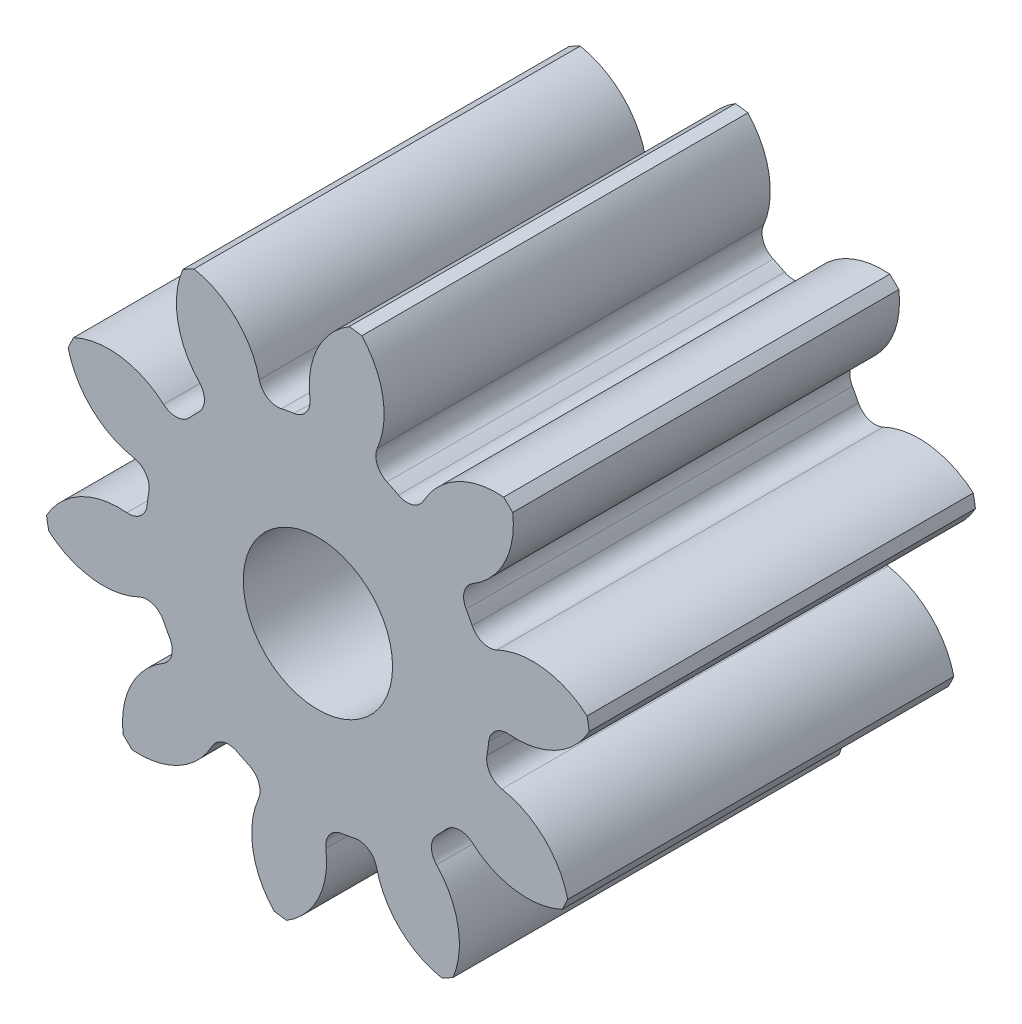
ISO-10303-21;
HEADER;
FILE_DESCRIPTION(('STEP AP214'),'2;1');
FILE_NAME('part.step','',(''),(''),'','','');
FILE_SCHEMA(('AUTOMOTIVE_DESIGN { 1 0 10303 214 1 1 1 1 }'));
ENDSEC;
DATA;
#1=APPLICATION_CONTEXT('core data for automotive mechanical design processes');
#2=APPLICATION_PROTOCOL_DEFINITION('international standard','automotive_design',2000,#1);
#3=PRODUCT_CONTEXT('',#1,'mechanical');
#4=PRODUCT('Part','Part','',(#3));
#5=PRODUCT_RELATED_PRODUCT_CATEGORY('part','',(#4));
#6=PRODUCT_DEFINITION_FORMATION('','',#4);
#7=PRODUCT_DEFINITION_CONTEXT('part definition',#1,'design');
#8=PRODUCT_DEFINITION('design','',#6,#7);
#9=PRODUCT_DEFINITION_SHAPE('','',#8);
#10=(LENGTH_UNIT() NAMED_UNIT(*) SI_UNIT(.MILLI.,.METRE.));
#11=(NAMED_UNIT(*) PLANE_ANGLE_UNIT() SI_UNIT($,.RADIAN.));
#12=(NAMED_UNIT(*) SI_UNIT($,.STERADIAN.) SOLID_ANGLE_UNIT());
#13=UNCERTAINTY_MEASURE_WITH_UNIT(LENGTH_MEASURE(1.E-05),#10,'distance_accuracy_value','');
#14=(GEOMETRIC_REPRESENTATION_CONTEXT(3) GLOBAL_UNCERTAINTY_ASSIGNED_CONTEXT((#13)) GLOBAL_UNIT_ASSIGNED_CONTEXT((#10,
#11,#12)) REPRESENTATION_CONTEXT('',''));
#15=CARTESIAN_POINT('',(0.,0.,0.));
#16=DIRECTION('',(0.,0.,1.));
#17=DIRECTION('',(1.,0.,0.));
#18=AXIS2_PLACEMENT_3D('',#15,#16,#17);
#19=CARTESIAN_POINT('',(0.,0.,95.25));
#20=DIRECTION('',(0.,0.,-1.));
#21=DIRECTION('',(-1.,0.,0.));
#22=AXIS2_PLACEMENT_3D('',#19,#20,#21);
#23=CYLINDRICAL_SURFACE('',#22,67.7333333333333);
#24=DIRECTION('',(0.,0.,-1.));
#25=VECTOR('',#24,1.);
#26=CARTESIAN_POINT('',(66.3852994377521,13.446057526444,47.625));
#27=LINE('',#26,#25);
#28=CARTESIAN_POINT('',(66.3852994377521,13.446057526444,95.25));
#29=VERTEX_POINT('',#28);
#30=CARTESIAN_POINT('',(66.3852994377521,13.446057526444,0.));
#31=VERTEX_POINT('',#30);
#32=EDGE_CURVE('E456',#29,#31,#27,.T.);
#33=ORIENTED_EDGE('',*,*,#32,.F.);
#34=CARTESIAN_POINT('',(0.,0.,95.25));
#35=DIRECTION('',(0.,0.,1.));
#36=DIRECTION('',(1.,0.,0.));
#37=AXIS2_PLACEMENT_3D('',#34,#35,#36);
#38=CIRCLE('',#37,67.7333333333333);
#39=CARTESIAN_POINT('',(66.933663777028,10.3773357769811,95.25));
#40=VERTEX_POINT('',#39);
#41=EDGE_CURVE('E797',#40,#29,#38,.T.);
#42=ORIENTED_EDGE('',*,*,#41,.F.);
#43=DIRECTION('',(0.,0.,-1.));
#44=VECTOR('',#43,1.);
#45=CARTESIAN_POINT('',(66.933663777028,10.3773357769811,47.625));
#46=LINE('',#45,#44);
#47=CARTESIAN_POINT('',(66.933663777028,10.3773357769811,0.));
#48=VERTEX_POINT('',#47);
#49=EDGE_CURVE('E791',#48,#40,#46,.F.);
#50=ORIENTED_EDGE('',*,*,#49,.F.);
#51=CARTESIAN_POINT('',(0.,0.,0.));
#52=DIRECTION('',(0.,0.,1.));
#53=DIRECTION('',(1.,0.,0.));
#54=AXIS2_PLACEMENT_3D('',#51,#52,#53);
#55=CIRCLE('',#54,67.7333333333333);
#56=EDGE_CURVE('E802',#48,#31,#55,.T.);
#57=ORIENTED_EDGE('',*,*,#56,.T.);
#58=EDGE_LOOP('',(#33,#42,#50,#57));
#59=FACE_BOUND('',#58,.T.);
#60=ADVANCED_FACE('F33',(#59),#23,.T.);
#61=DIRECTION('',(0.,0.,-1.));
#62=VECTOR('',#61,1.);
#63=CARTESIAN_POINT('',(48.0508265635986,47.7380614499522,47.625));
#64=LINE('',#63,#62);
#65=CARTESIAN_POINT('',(48.0508265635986,47.7380614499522,0.));
#66=VERTEX_POINT('',#65);
#67=CARTESIAN_POINT('',(48.0508265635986,47.7380614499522,95.25));
#68=VERTEX_POINT('',#67);
#69=EDGE_CURVE('E427',#66,#68,#64,.F.);
#70=ORIENTED_EDGE('',*,*,#69,.F.);
#71=CARTESIAN_POINT('',(45.803441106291,49.8983890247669,0.));
#72=VERTEX_POINT('',#71);
#73=EDGE_CURVE('E805',#66,#72,#55,.T.);
#74=ORIENTED_EDGE('',*,*,#73,.T.);
#75=DIRECTION('',(0.,0.,-1.));
#76=VECTOR('',#75,1.);
#77=CARTESIAN_POINT('',(45.803441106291,49.8983890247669,47.625));
#78=LINE('',#77,#76);
#79=CARTESIAN_POINT('',(45.803441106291,49.8983890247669,95.25));
#80=VERTEX_POINT('',#79);
#81=EDGE_CURVE('E489',#80,#72,#78,.T.);
#82=ORIENTED_EDGE('',*,*,#81,.F.);
#83=EDGE_CURVE('E800',#68,#80,#38,.T.);
#84=ORIENTED_EDGE('',*,*,#83,.F.);
#85=EDGE_LOOP('',(#70,#74,#82,#84));
#86=FACE_BOUND('',#85,.T.);
#87=ADVANCED_FACE('F921',(#86),#23,.T.);
#88=CARTESIAN_POINT('',(0.,0.,95.25));
#89=DIRECTION('',(0.,0.,1.));
#90=DIRECTION('',(1.,0.,0.));
#91=AXIS2_PLACEMENT_3D('',#88,#89,#90);
#92=PLANE('',#91);
#93=CARTESIAN_POINT('',(0.,0.,95.2500000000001));
#94=DIRECTION('',(0.,0.,1.));
#95=DIRECTION('',(1.,0.,0.));
#96=AXIS2_PLACEMENT_3D('',#93,#94,#95);
#97=CIRCLE('',#96,18.415);
#98=CARTESIAN_POINT('',(18.415,0.,95.2499999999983));
#99=VERTEX_POINT('',#98);
#100=EDGE_CURVE('E444',#99,#99,#97,.T.);
#101=ORIENTED_EDGE('',*,*,#100,.F.);
#102=EDGE_LOOP('',(#101));
#103=FACE_BOUND('',#102,.T.);
#104=ORIENTED_EDGE('',*,*,#41,.T.);
#105=CARTESIAN_POINT('',(53.0000079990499,-2.07030117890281,95.25));
#106=DIRECTION('',(0.,0.,-1.));
#107=DIRECTION('',(0.809016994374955,0.587785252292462,0.));
#108=AXIS2_PLACEMENT_3D('',#105,#106,#107);
#109=CIRCLE('',#108,20.4920329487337);
#110=CARTESIAN_POINT('',(44.1635560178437,16.4186287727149,95.25));
#111=VERTEX_POINT('',#110);
#112=EDGE_CURVE('E436',#111,#29,#109,.T.);
#113=ORIENTED_EDGE('',*,*,#112,.F.);
#114=CARTESIAN_POINT('',(42.1823096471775,20.5640850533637,95.25));
#115=DIRECTION('',(0.,0.,1.));
#116=DIRECTION('',(-0.809016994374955,-0.587785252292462,0.));
#117=AXIS2_PLACEMENT_3D('',#114,#115,#116);
#118=CIRCLE('',#117,4.59457777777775);
#119=CARTESIAN_POINT('',(38.0523601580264,18.5507142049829,95.25));
#120=VERTEX_POINT('',#119);
#121=EDGE_CURVE('E434',#120,#111,#118,.T.);
#122=ORIENTED_EDGE('',*,*,#121,.F.);
#123=CARTESIAN_POINT('',(0.,0.,95.25));
#124=DIRECTION('',(0.,0.,-1.));
#125=DIRECTION('',(0.809016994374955,0.587785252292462,0.));
#126=AXIS2_PLACEMENT_3D('',#123,#124,#125);
#127=CIRCLE('',#126,42.3333333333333);
#128=CARTESIAN_POINT('',(36.5602600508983,21.3414736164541,95.25));
#129=VERTEX_POINT('',#128);
#130=EDGE_CURVE('E419',#129,#120,#127,.T.);
#131=ORIENTED_EDGE('',*,*,#130,.F.);
#132=CARTESIAN_POINT('',(40.5282669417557,23.6577348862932,95.25));
#133=DIRECTION('',(0.,0.,1.));
#134=DIRECTION('',(-0.809016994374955,-0.587785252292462,0.));
#135=AXIS2_PLACEMENT_3D('',#132,#133,#134);
#136=CIRCLE('',#135,4.59457777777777);
#137=CARTESIAN_POINT('',(38.1812689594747,27.6076393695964,95.25));
#138=VERTEX_POINT('',#137);
#139=EDGE_CURVE('E411',#138,#129,#136,.T.);
#140=ORIENTED_EDGE('',*,*,#139,.F.);
#141=CARTESIAN_POINT('',(27.713547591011,45.2243991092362,95.25));
#142=DIRECTION('',(0.,0.,-1.));
#143=DIRECTION('',(-0.809016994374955,-0.587785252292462,0.));
#144=AXIS2_PLACEMENT_3D('',#141,#142,#143);
#145=CIRCLE('',#144,20.4920329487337);
#146=EDGE_CURVE('E441',#68,#138,#145,.T.);
#147=ORIENTED_EDGE('',*,*,#146,.F.);
#148=ORIENTED_EDGE('',*,*,#83,.T.);
#149=CARTESIAN_POINT('',(44.0947996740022,29.4777142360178,95.25));
#150=DIRECTION('',(0.,0.,-1.));
#151=DIRECTION('',(0.309016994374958,0.95105651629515,0.));
#152=AXIS2_PLACEMENT_3D('',#149,#150,#151);
#153=CIRCLE('',#152,20.4920329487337);
#154=CARTESIAN_POINT('',(26.0784394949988,39.2416366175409,95.25));
#155=VERTEX_POINT('',#154);
#156=EDGE_CURVE('E465',#155,#80,#153,.T.);
#157=ORIENTED_EDGE('',*,*,#156,.F.);
#158=CARTESIAN_POINT('',(22.0389394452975,41.4308338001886,95.25));
#159=DIRECTION('',(0.,0.,1.));
#160=DIRECTION('',(-0.309016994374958,-0.95105651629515,0.));
#161=AXIS2_PLACEMENT_3D('',#158,#159,#160);
#162=CIRCLE('',#161,4.59457777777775);
#163=CARTESIAN_POINT('',(19.881169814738,37.3744591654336,95.25));
#164=VERTEX_POINT('',#163);
#165=EDGE_CURVE('E463',#164,#155,#162,.T.);
#166=ORIENTED_EDGE('',*,*,#165,.F.);
#167=CARTESIAN_POINT('',(0.,0.,95.25));
#168=DIRECTION('',(0.,0.,-1.));
#169=DIRECTION('',(0.309016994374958,0.95105651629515,0.));
#170=AXIS2_PLACEMENT_3D('',#167,#168,#169);
#171=CIRCLE('',#170,42.3333333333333);
#172=CARTESIAN_POINT('',(17.0336682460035,38.7551965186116,95.25));
#173=VERTEX_POINT('',#172);
#174=EDGE_CURVE('E460',#173,#164,#171,.T.);
#175=ORIENTED_EDGE('',*,*,#174,.F.);
#176=CARTESIAN_POINT('',(18.8823890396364,42.9614271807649,95.25));
#177=DIRECTION('',(0.,0.,1.));
#178=DIRECTION('',(-0.309016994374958,-0.95105651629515,0.));
#179=AXIS2_PLACEMENT_3D('',#176,#177,#178);
#180=CIRCLE('',#179,4.59457777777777);
#181=CARTESIAN_POINT('',(14.6619321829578,44.77743623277,95.25));
#182=VERTEX_POINT('',#181);
#183=EDGE_CURVE('E458',#182,#173,#180,.T.);
#184=ORIENTED_EDGE('',*,*,#183,.F.);
#185=CARTESIAN_POINT('',(-4.16150386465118,52.8769220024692,95.25));
#186=DIRECTION('',(0.,0.,-1.));
#187=DIRECTION('',(-0.309016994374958,-0.95105651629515,0.));
#188=AXIS2_PLACEMENT_3D('',#185,#186,#187);
#189=CIRCLE('',#188,20.4920329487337);
#190=CARTESIAN_POINT('',(10.8142067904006,66.8644702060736,95.25));
#191=VERTEX_POINT('',#190);
#192=EDGE_CURVE('E468',#191,#182,#189,.T.);
#193=ORIENTED_EDGE('',*,*,#192,.F.);
#194=CARTESIAN_POINT('',(7.72622507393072,67.2912318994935,95.25));
#195=VERTEX_POINT('',#194);
#196=EDGE_CURVE('E833',#191,#195,#38,.T.);
#197=ORIENTED_EDGE('',*,*,#196,.T.);
#198=CARTESIAN_POINT('',(18.3468766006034,49.7662447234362,95.25));
#199=DIRECTION('',(0.,0.,-1.));
#200=DIRECTION('',(-0.309016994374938,0.951056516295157,0.));
#201=AXIS2_PLACEMENT_3D('',#198,#199,#200);
#202=CIRCLE('',#201,20.4920329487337);
#203=CARTESIAN_POINT('',(-1.96775454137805,47.0756730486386,95.25));
#204=VERTEX_POINT('',#203);
#205=EDGE_CURVE('E500',#204,#195,#202,.T.);
#206=ORIENTED_EDGE('',*,*,#205,.F.);
#207=CARTESIAN_POINT('',(-6.52255654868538,46.4724122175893,95.25));
#208=DIRECTION('',(0.,0.,1.));
#209=DIRECTION('',(0.309016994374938,-0.951056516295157,0.));
#210=AXIS2_PLACEMENT_3D('',#207,#208,#209);
#211=CIRCLE('',#210,4.59457777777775);
#212=CARTESIAN_POINT('',(-5.88395166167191,41.9224310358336,95.25));
#213=VERTEX_POINT('',#212);
#214=EDGE_CURVE('E498',#213,#204,#211,.T.);
#215=ORIENTED_EDGE('',*,*,#214,.F.);
#216=CARTESIAN_POINT('',(0.,0.,95.25));
#217=DIRECTION('',(0.,0.,-1.));
#218=DIRECTION('',(-0.309016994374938,0.951056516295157,0.));
#219=AXIS2_PLACEMENT_3D('',#216,#217,#218);
#220=CIRCLE('',#219,42.3333333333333);
#221=CARTESIAN_POINT('',(-8.99920587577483,41.365751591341,95.25));
#222=VERTEX_POINT('',#221);
#223=EDGE_CURVE('E495',#222,#213,#220,.T.);
#224=ORIENTED_EDGE('',*,*,#223,.F.);
#225=CARTESIAN_POINT('',(-9.9759196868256,45.8553144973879,95.25));
#226=DIRECTION('',(0.,0.,1.));
#227=DIRECTION('',(0.309016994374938,-0.951056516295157,0.));
#228=AXIS2_PLACEMENT_3D('',#225,#226,#227);
#229=CIRCLE('',#228,4.59457777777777);
#230=CARTESIAN_POINT('',(-14.4577643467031,44.8437743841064,95.25));
#231=VERTEX_POINT('',#230);
#232=EDGE_CURVE('E493',#231,#222,#229,.T.);
#233=ORIENTED_EDGE('',*,*,#232,.F.);
#234=CARTESIAN_POINT('',(-34.4470022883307,40.332257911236,95.25));
#235=DIRECTION('',(0.,0.,-1.));
#236=DIRECTION('',(0.309016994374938,-0.951056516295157,0.));
#237=AXIS2_PLACEMENT_3D('',#234,#235,#236);
#238=CIRCLE('',#237,20.4920329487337);
#239=CARTESIAN_POINT('',(-30.5530724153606,60.4509239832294,95.25));
#240=VERTEX_POINT('',#239);
#241=EDGE_CURVE('E503',#240,#231,#238,.T.);
#242=ORIENTED_EDGE('',*,*,#241,.F.);
#243=CARTESIAN_POINT('',(-33.3021463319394,58.9811113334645,95.25));
#244=VERTEX_POINT('',#243);
#245=EDGE_CURVE('E903',#240,#244,#38,.T.);
#246=ORIENTED_EDGE('',*,*,#245,.T.);
#247=CARTESIAN_POINT('',(-14.4089297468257,51.045761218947,95.25));
#248=DIRECTION('',(0.,0.,-1.));
#249=DIRECTION('',(-0.809016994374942,0.58778525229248,0.));
#250=AXIS2_PLACEMENT_3D('',#247,#248,#249);
#251=CIRCLE('',#250,20.4920329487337);
#252=CARTESIAN_POINT('',(-29.2623332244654,36.9284024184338,95.25));
#253=VERTEX_POINT('',#252);
#254=EDGE_CURVE('E538',#253,#244,#251,.T.);
#255=ORIENTED_EDGE('',*,*,#254,.F.);
#256=CARTESIAN_POINT('',(-32.5926576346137,33.7631087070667,95.25));
#257=DIRECTION('',(0.,0.,1.));
#258=DIRECTION('',(0.809016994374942,-0.58778525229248,0.));
#259=AXIS2_PLACEMENT_3D('',#256,#257,#258);
#260=CIRCLE('',#259,4.59457777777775);
#261=CARTESIAN_POINT('',(-29.4016035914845,30.4574591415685,95.25));
#262=VERTEX_POINT('',#261);
#263=EDGE_CURVE('E536',#262,#253,#260,.T.);
#264=ORIENTED_EDGE('',*,*,#263,.F.);
#265=CARTESIAN_POINT('',(0.,0.,95.25));
#266=DIRECTION('',(0.,0.,-1.));
#267=DIRECTION('',(-0.809016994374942,0.58778525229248,0.));
#268=AXIS2_PLACEMENT_3D('',#265,#266,#267);
#269=CIRCLE('',#268,42.3333333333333);
#270=CARTESIAN_POINT('',(-31.5946892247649,28.1759955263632,95.25));
#271=VERTEX_POINT('',#270);
#272=EDGE_CURVE('E533',#271,#262,#269,.T.);
#273=ORIENTED_EDGE('',*,*,#272,.F.);
#274=CARTESIAN_POINT('',(-35.0237661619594,31.2340302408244,95.25));
#275=DIRECTION('',(0.,0.,1.));
#276=DIRECTION('',(0.809016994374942,-0.58778525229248,0.));
#277=AXIS2_PLACEMENT_3D('',#274,#275,#276);
#278=CIRCLE('',#277,4.59457777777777);
#279=CARTESIAN_POINT('',(-38.0550862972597,27.781314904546,95.25));
#280=VERTEX_POINT('',#279);
#281=EDGE_CURVE('E531',#280,#271,#278,.T.);
#282=ORIENTED_EDGE('',*,*,#281,.F.);
#283=CARTESIAN_POINT('',(-51.5749166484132,12.3820421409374,95.25));
#284=DIRECTION('',(0.,0.,-1.));
#285=DIRECTION('',(0.809016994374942,-0.58778525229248,0.));
#286=AXIS2_PLACEMENT_3D('',#283,#284,#285);
#287=CIRCLE('',#286,20.4920329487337);
#288=CARTESIAN_POINT('',(-60.2501164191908,30.9471794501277,95.25));
#289=VERTEX_POINT('',#288);
#290=EDGE_CURVE('E541',#289,#280,#287,.T.);
#291=ORIENTED_EDGE('',*,*,#290,.F.);
#292=CARTESIAN_POINT('',(-61.6102297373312,28.1422109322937,95.25));
#293=VERTEX_POINT('',#292);
#294=EDGE_CURVE('E899',#289,#293,#38,.T.);
#295=ORIENTED_EDGE('',*,*,#294,.T.);
#296=CARTESIAN_POINT('',(-41.6610146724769,32.8275319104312,95.25));
#297=DIRECTION('',(0.,0.,-1.));
#298=DIRECTION('',(-1.,0.,0.));
#299=AXIS2_PLACEMENT_3D('',#296,#297,#298);
#300=CIRCLE('',#299,20.4920329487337);
#301=CARTESIAN_POINT('',(-45.3796952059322,12.6757372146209,95.25));
#302=VERTEX_POINT('',#301);
#303=EDGE_CURVE('E576',#302,#293,#300,.T.);
#304=ORIENTED_EDGE('',*,*,#303,.F.);
#305=CARTESIAN_POINT('',(-46.2134712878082,8.15744523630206,95.25));
#306=DIRECTION('',(0.,0.,1.));
#307=DIRECTION('',(1.,0.,0.));
#308=AXIS2_PLACEMENT_3D('',#305,#306,#307);
#309=CIRCLE('',#308,4.59457777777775);
#310=CARTESIAN_POINT('',(-41.688842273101,7.35877306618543,95.25));
#311=VERTEX_POINT('',#310);
#312=EDGE_CURVE('E574',#311,#302,#309,.T.);
#313=ORIENTED_EDGE('',*,*,#312,.F.);
#314=CARTESIAN_POINT('',(0.,0.,95.25));
#315=DIRECTION('',(0.,0.,-1.));
#316=DIRECTION('',(-1.,0.,0.));
#317=AXIS2_PLACEMENT_3D('',#314,#315,#316);
#318=CIRCLE('',#317,42.3333333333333);
#319=CARTESIAN_POINT('',(-42.1220751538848,4.2239668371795,95.25));
#320=VERTEX_POINT('',#319);
#321=EDGE_CURVE('E571',#320,#311,#318,.T.);
#322=ORIENTED_EDGE('',*,*,#321,.F.);
#323=CARTESIAN_POINT('',(-46.6937243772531,4.68240803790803,95.25));
#324=DIRECTION('',(0.,0.,1.));
#325=DIRECTION('',(1.,0.,0.));
#326=AXIS2_PLACEMENT_3D('',#323,#324,#325);
#327=CIRCLE('',#326,4.59457777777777);
#328=CARTESIAN_POINT('',(-47.1166587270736,0.107337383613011,95.25));
#329=VERTEX_POINT('',#328);
#330=EDGE_CURVE('E569',#329,#320,#327,.T.);
#331=ORIENTED_EDGE('',*,*,#330,.F.);
#332=CARTESIAN_POINT('',(-49.0029658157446,-20.2976928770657,95.25));
#333=DIRECTION('',(0.,0.,-1.));
#334=DIRECTION('',(1.,0.,0.));
#335=AXIS2_PLACEMENT_3D('',#332,#333,#334);
#336=CIRCLE('',#335,20.4920329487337);
#337=CARTESIAN_POINT('',(-66.9336637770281,-10.3773357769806,95.25));
#338=VERTEX_POINT('',#337);
#339=EDGE_CURVE('E579',#338,#329,#336,.T.);
#340=ORIENTED_EDGE('',*,*,#339,.F.);
#341=CARTESIAN_POINT('',(-66.3852994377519,-13.4460575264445,95.25));
#342=VERTEX_POINT('',#341);
#343=EDGE_CURVE('E895',#338,#342,#38,.T.);
#344=ORIENTED_EDGE('',*,*,#343,.T.);
#345=CARTESIAN_POINT('',(-53.0000079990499,2.07030117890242,95.25));
#346=DIRECTION('',(0.,0.,-1.));
#347=DIRECTION('',(-0.809016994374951,-0.587785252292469,0.));
#348=AXIS2_PLACEMENT_3D('',#345,#346,#347);
#349=CIRCLE('',#348,20.4920329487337);
#350=CARTESIAN_POINT('',(-44.1635560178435,-16.4186287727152,95.25));
#351=VERTEX_POINT('',#350);
#352=EDGE_CURVE('E614',#351,#342,#349,.T.);
#353=ORIENTED_EDGE('',*,*,#352,.F.);
#354=CARTESIAN_POINT('',(-42.1823096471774,-20.5640850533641,95.25));
#355=DIRECTION('',(0.,0.,1.));
#356=DIRECTION('',(0.809016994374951,0.587785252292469,0.));
#357=AXIS2_PLACEMENT_3D('',#354,#355,#356);
#358=CIRCLE('',#357,4.59457777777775);
#359=CARTESIAN_POINT('',(-38.0523601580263,-18.5507142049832,95.25));
#360=VERTEX_POINT('',#359);
#361=EDGE_CURVE('E612',#360,#351,#358,.T.);
#362=ORIENTED_EDGE('',*,*,#361,.F.);
#363=CARTESIAN_POINT('',(0.,0.,95.25));
#364=DIRECTION('',(0.,0.,-1.));
#365=DIRECTION('',(-0.809016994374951,-0.587785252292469,0.));
#366=AXIS2_PLACEMENT_3D('',#363,#364,#365);
#367=CIRCLE('',#366,42.3333333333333);
#368=CARTESIAN_POINT('',(-36.5602600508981,-21.3414736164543,95.25));
#369=VERTEX_POINT('',#368);
#370=EDGE_CURVE('E609',#369,#360,#367,.T.);
#371=ORIENTED_EDGE('',*,*,#370,.F.);
#372=CARTESIAN_POINT('',(-40.5282669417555,-23.6577348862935,95.25));
#373=DIRECTION('',(0.,0.,1.));
#374=DIRECTION('',(0.809016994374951,0.587785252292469,0.));
#375=AXIS2_PLACEMENT_3D('',#372,#373,#374);
#376=CIRCLE('',#375,4.59457777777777);
#377=CARTESIAN_POINT('',(-38.1812689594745,-27.6076393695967,95.25));
#378=VERTEX_POINT('',#377);
#379=EDGE_CURVE('E607',#378,#369,#376,.T.);
#380=ORIENTED_EDGE('',*,*,#379,.F.);
#381=CARTESIAN_POINT('',(-27.7135475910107,-45.2243991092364,95.25));
#382=DIRECTION('',(0.,0.,-1.));
#383=DIRECTION('',(0.809016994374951,0.587785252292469,0.));
#384=AXIS2_PLACEMENT_3D('',#381,#382,#383);
#385=CIRCLE('',#384,20.4920329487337);
#386=CARTESIAN_POINT('',(-48.0508265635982,-47.7380614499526,95.25));
#387=VERTEX_POINT('',#386);
#388=EDGE_CURVE('E617',#387,#378,#385,.T.);
#389=ORIENTED_EDGE('',*,*,#388,.F.);
#390=CARTESIAN_POINT('',(-45.8034411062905,-49.8983890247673,95.25));
#391=VERTEX_POINT('',#390);
#392=EDGE_CURVE('E891',#387,#391,#38,.T.);
#393=ORIENTED_EDGE('',*,*,#392,.T.);
#394=CARTESIAN_POINT('',(-44.094799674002,-29.4777142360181,95.25));
#395=DIRECTION('',(0.,0.,-1.));
#396=DIRECTION('',(-0.309016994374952,-0.951056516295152,0.));
#397=AXIS2_PLACEMENT_3D('',#394,#395,#396);
#398=CIRCLE('',#397,20.4920329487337);
#399=CARTESIAN_POINT('',(-26.0784394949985,-39.241636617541,95.25));
#400=VERTEX_POINT('',#399);
#401=EDGE_CURVE('E652',#400,#391,#398,.T.);
#402=ORIENTED_EDGE('',*,*,#401,.F.);
#403=CARTESIAN_POINT('',(-22.0389394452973,-41.4308338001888,95.25));
#404=DIRECTION('',(0.,0.,1.));
#405=DIRECTION('',(0.309016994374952,0.951056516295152,0.));
#406=AXIS2_PLACEMENT_3D('',#403,#404,#405);
#407=CIRCLE('',#406,4.59457777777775);
#408=CARTESIAN_POINT('',(-19.8811698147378,-37.3744591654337,95.25));
#409=VERTEX_POINT('',#408);
#410=EDGE_CURVE('E650',#409,#400,#407,.T.);
#411=ORIENTED_EDGE('',*,*,#410,.F.);
#412=CARTESIAN_POINT('',(0.,0.,95.25));
#413=DIRECTION('',(0.,0.,-1.));
#414=DIRECTION('',(-0.309016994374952,-0.951056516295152,0.));
#415=AXIS2_PLACEMENT_3D('',#412,#413,#414);
#416=CIRCLE('',#415,42.3333333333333);
#417=CARTESIAN_POINT('',(-17.0336682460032,-38.7551965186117,95.25));
#418=VERTEX_POINT('',#417);
#419=EDGE_CURVE('E647',#418,#409,#416,.T.);
#420=ORIENTED_EDGE('',*,*,#419,.F.);
#421=CARTESIAN_POINT('',(-18.8823890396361,-42.961427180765,95.25));
#422=DIRECTION('',(0.,0.,1.));
#423=DIRECTION('',(0.309016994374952,0.951056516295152,0.));
#424=AXIS2_PLACEMENT_3D('',#421,#422,#423);
#425=CIRCLE('',#424,4.59457777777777);
#426=CARTESIAN_POINT('',(-14.6619321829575,-44.7774362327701,95.25));
#427=VERTEX_POINT('',#426);
#428=EDGE_CURVE('E645',#427,#418,#425,.T.);
#429=ORIENTED_EDGE('',*,*,#428,.F.);
#430=CARTESIAN_POINT('',(4.16150386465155,-52.8769220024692,95.25));
#431=DIRECTION('',(0.,0.,-1.));
#432=DIRECTION('',(0.309016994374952,0.951056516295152,0.));
#433=AXIS2_PLACEMENT_3D('',#430,#431,#432);
#434=CIRCLE('',#433,20.4920329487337);
#435=CARTESIAN_POINT('',(-10.8142067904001,-66.8644702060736,95.25));
#436=VERTEX_POINT('',#435);
#437=EDGE_CURVE('E655',#436,#427,#434,.T.);
#438=ORIENTED_EDGE('',*,*,#437,.F.);
#439=CARTESIAN_POINT('',(-7.7262250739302,-67.2912318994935,95.25));
#440=VERTEX_POINT('',#439);
#441=EDGE_CURVE('E887',#436,#440,#38,.T.);
#442=ORIENTED_EDGE('',*,*,#441,.T.);
#443=CARTESIAN_POINT('',(-18.3468766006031,-49.7662447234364,95.25));
#444=DIRECTION('',(0.,0.,-1.));
#445=DIRECTION('',(0.309016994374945,-0.951056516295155,0.));
#446=AXIS2_PLACEMENT_3D('',#443,#444,#445);
#447=CIRCLE('',#446,20.4920329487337);
#448=CARTESIAN_POINT('',(1.96775454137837,-47.0756730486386,95.25));
#449=VERTEX_POINT('',#448);
#450=EDGE_CURVE('E690',#449,#440,#447,.T.);
#451=ORIENTED_EDGE('',*,*,#450,.F.);
#452=CARTESIAN_POINT('',(6.52255654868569,-46.4724122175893,95.25));
#453=DIRECTION('',(0.,0.,1.));
#454=DIRECTION('',(-0.309016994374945,0.951056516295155,0.));
#455=AXIS2_PLACEMENT_3D('',#452,#453,#454);
#456=CIRCLE('',#455,4.59457777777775);
#457=CARTESIAN_POINT('',(5.88395166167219,-41.9224310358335,95.25));
#458=VERTEX_POINT('',#457);
#459=EDGE_CURVE('E688',#458,#449,#456,.T.);
#460=ORIENTED_EDGE('',*,*,#459,.F.);
#461=CARTESIAN_POINT('',(0.,0.,95.25));
#462=DIRECTION('',(0.,0.,-1.));
#463=DIRECTION('',(0.309016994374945,-0.951056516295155,0.));
#464=AXIS2_PLACEMENT_3D('',#461,#462,#463);
#465=CIRCLE('',#464,42.3333333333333);
#466=CARTESIAN_POINT('',(8.99920587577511,-41.365751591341,95.25));
#467=VERTEX_POINT('',#466);
#468=EDGE_CURVE('E685',#467,#458,#465,.T.);
#469=ORIENTED_EDGE('',*,*,#468,.F.);
#470=CARTESIAN_POINT('',(9.97591968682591,-45.8553144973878,95.25));
#471=DIRECTION('',(0.,0.,1.));
#472=DIRECTION('',(-0.309016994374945,0.951056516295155,0.));
#473=AXIS2_PLACEMENT_3D('',#470,#471,#472);
#474=CIRCLE('',#473,4.59457777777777);
#475=CARTESIAN_POINT('',(14.4577643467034,-44.8437743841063,95.25));
#476=VERTEX_POINT('',#475);
#477=EDGE_CURVE('E683',#476,#467,#474,.T.);
#478=ORIENTED_EDGE('',*,*,#477,.F.);
#479=CARTESIAN_POINT('',(34.4470022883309,-40.3322579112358,95.25));
#480=DIRECTION('',(0.,0.,-1.));
#481=DIRECTION('',(-0.309016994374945,0.951056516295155,0.));
#482=AXIS2_PLACEMENT_3D('',#479,#480,#481);
#483=CIRCLE('',#482,20.4920329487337);
#484=CARTESIAN_POINT('',(30.553072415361,-60.4509239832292,95.25));
#485=VERTEX_POINT('',#484);
#486=EDGE_CURVE('E693',#485,#476,#483,.T.);
#487=ORIENTED_EDGE('',*,*,#486,.F.);
#488=CARTESIAN_POINT('',(33.3021463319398,-58.9811113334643,95.25));
#489=VERTEX_POINT('',#488);
#490=EDGE_CURVE('E886',#485,#489,#38,.T.);
#491=ORIENTED_EDGE('',*,*,#490,.T.);
#492=CARTESIAN_POINT('',(14.4089297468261,-51.0457612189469,95.25));
#493=DIRECTION('',(0.,0.,-1.));
#494=DIRECTION('',(0.809016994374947,-0.587785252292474,0.));
#495=AXIS2_PLACEMENT_3D('',#492,#493,#494);
#496=CIRCLE('',#495,20.4920329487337);
#497=CARTESIAN_POINT('',(29.2623332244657,-36.9284024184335,95.25));
#498=VERTEX_POINT('',#497);
#499=EDGE_CURVE('E728',#498,#489,#496,.T.);
#500=ORIENTED_EDGE('',*,*,#499,.F.);
#501=CARTESIAN_POINT('',(32.5926576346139,-33.7631087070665,95.25));
#502=DIRECTION('',(0.,0.,1.));
#503=DIRECTION('',(-0.809016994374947,0.587785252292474,0.));
#504=AXIS2_PLACEMENT_3D('',#501,#502,#503);
#505=CIRCLE('',#504,4.59457777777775);
#506=CARTESIAN_POINT('',(29.4016035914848,-30.4574591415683,95.25));
#507=VERTEX_POINT('',#506);
#508=EDGE_CURVE('E726',#507,#498,#505,.T.);
#509=ORIENTED_EDGE('',*,*,#508,.F.);
#510=CARTESIAN_POINT('',(0.,0.,95.25));
#511=DIRECTION('',(0.,0.,-1.));
#512=DIRECTION('',(0.809016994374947,-0.587785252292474,0.));
#513=AXIS2_PLACEMENT_3D('',#510,#511,#512);
#514=CIRCLE('',#513,42.3333333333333);
#515=CARTESIAN_POINT('',(31.5946892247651,-28.1759955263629,95.25));
#516=VERTEX_POINT('',#515);
#517=EDGE_CURVE('E723',#516,#507,#514,.T.);
#518=ORIENTED_EDGE('',*,*,#517,.F.);
#519=CARTESIAN_POINT('',(35.0237661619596,-31.2340302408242,95.25));
#520=DIRECTION('',(0.,0.,1.));
#521=DIRECTION('',(-0.809016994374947,0.587785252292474,0.));
#522=AXIS2_PLACEMENT_3D('',#519,#520,#521);
#523=CIRCLE('',#522,4.59457777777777);
#524=CARTESIAN_POINT('',(38.05508629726,-27.7813149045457,95.25));
#525=VERTEX_POINT('',#524);
#526=EDGE_CURVE('E721',#525,#516,#523,.T.);
#527=ORIENTED_EDGE('',*,*,#526,.F.);
#528=CARTESIAN_POINT('',(51.5749166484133,-12.3820421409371,95.25));
#529=DIRECTION('',(0.,0.,-1.));
#530=DIRECTION('',(-0.809016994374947,0.587785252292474,0.));
#531=AXIS2_PLACEMENT_3D('',#528,#529,#530);
#532=CIRCLE('',#531,20.4920329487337);
#533=CARTESIAN_POINT('',(60.250116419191,-30.9471794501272,95.25));
#534=VERTEX_POINT('',#533);
#535=EDGE_CURVE('E731',#534,#525,#532,.T.);
#536=ORIENTED_EDGE('',*,*,#535,.F.);
#537=CARTESIAN_POINT('',(61.6102297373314,-28.1422109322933,95.25));
#538=VERTEX_POINT('',#537);
#539=EDGE_CURVE('E801',#534,#538,#38,.T.);
#540=ORIENTED_EDGE('',*,*,#539,.T.);
#541=CARTESIAN_POINT('',(41.6610146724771,-32.8275319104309,95.25));
#542=DIRECTION('',(0.,0.,-1.));
#543=DIRECTION('',(1.,0.,0.));
#544=AXIS2_PLACEMENT_3D('',#541,#542,#543);
#545=CIRCLE('',#544,20.4920329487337);
#546=CARTESIAN_POINT('',(45.3796952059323,-12.6757372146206,95.25));
#547=VERTEX_POINT('',#546);
#548=EDGE_CURVE('E766',#547,#538,#545,.T.);
#549=ORIENTED_EDGE('',*,*,#548,.F.);
#550=CARTESIAN_POINT('',(46.2134712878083,-8.15744523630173,95.25));
#551=DIRECTION('',(0.,0.,1.));
#552=DIRECTION('',(-1.,0.,0.));
#553=AXIS2_PLACEMENT_3D('',#550,#551,#552);
#554=CIRCLE('',#553,4.59457777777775);
#555=CARTESIAN_POINT('',(41.6888422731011,-7.35877306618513,95.25));
#556=VERTEX_POINT('',#555);
#557=EDGE_CURVE('E764',#556,#547,#554,.T.);
#558=ORIENTED_EDGE('',*,*,#557,.F.);
#559=CARTESIAN_POINT('',(0.,0.,95.25));
#560=DIRECTION('',(0.,0.,-1.));
#561=DIRECTION('',(1.,0.,0.));
#562=AXIS2_PLACEMENT_3D('',#559,#560,#561);
#563=CIRCLE('',#562,42.3333333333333);
#564=CARTESIAN_POINT('',(42.1220751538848,-4.22396683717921,95.25));
#565=VERTEX_POINT('',#564);
#566=EDGE_CURVE('E761',#565,#556,#563,.T.);
#567=ORIENTED_EDGE('',*,*,#566,.F.);
#568=CARTESIAN_POINT('',(46.6937243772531,-4.6824080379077,95.25));
#569=DIRECTION('',(0.,0.,1.));
#570=DIRECTION('',(-1.,0.,0.));
#571=AXIS2_PLACEMENT_3D('',#568,#569,#570);
#572=CIRCLE('',#571,4.59457777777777);
#573=CARTESIAN_POINT('',(47.1166587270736,-0.107337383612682,95.25));
#574=VERTEX_POINT('',#573);
#575=EDGE_CURVE('E759',#574,#565,#572,.T.);
#576=ORIENTED_EDGE('',*,*,#575,.F.);
#577=CARTESIAN_POINT('',(49.0029658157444,20.2976928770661,95.25));
#578=DIRECTION('',(0.,0.,-1.));
#579=DIRECTION('',(-1.,0.,0.));
#580=AXIS2_PLACEMENT_3D('',#577,#578,#579);
#581=CIRCLE('',#580,20.4920329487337);
#582=EDGE_CURVE('E769',#40,#574,#581,.T.);
#583=ORIENTED_EDGE('',*,*,#582,.F.);
#584=EDGE_LOOP('',(#104,#113,#122,#131,#140,#147,#148,#157,#166,#175,#184,#193,#197,#206,#215,
#224,#233,#242,#246,#255,#264,#273,#282,#291,#295,#304,#313,#322,#331,#340,#344,#353,#362,#371,
#380,#389,#393,#402,#411,#420,#429,#438,#442,#451,#460,#469,#478,#487,#491,#500,#509,#518,#527,
#536,#540,#549,#558,#567,#576,#583));
#585=FACE_BOUND('',#584,.T.);
#586=ADVANCED_FACE('F432',(#103,#585),#92,.T.);
#587=CARTESIAN_POINT('',(0.,0.,0.));
#588=DIRECTION('',(0.,0.,1.));
#589=DIRECTION('',(1.,0.,0.));
#590=AXIS2_PLACEMENT_3D('',#587,#588,#589);
#591=PLANE('',#590);
#592=CARTESIAN_POINT('',(0.,0.,0.));
#593=DIRECTION('',(0.,0.,1.));
#594=DIRECTION('',(1.,0.,0.));
#595=AXIS2_PLACEMENT_3D('',#592,#593,#594);
#596=CIRCLE('',#595,18.415);
#597=CARTESIAN_POINT('',(18.415,0.,-1.77635683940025E-12));
#598=VERTEX_POINT('',#597);
#599=EDGE_CURVE('E36',#598,#598,#596,.T.);
#600=ORIENTED_EDGE('',*,*,#599,.T.);
#601=EDGE_LOOP('',(#600));
#602=FACE_BOUND('',#601,.T.);
#603=CARTESIAN_POINT('',(53.0000079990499,-2.07030117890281,0.));
#604=DIRECTION('',(0.,0.,-1.));
#605=DIRECTION('',(0.809016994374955,0.587785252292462,0.));
#606=AXIS2_PLACEMENT_3D('',#603,#604,#605);
#607=CIRCLE('',#606,20.4920329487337);
#608=CARTESIAN_POINT('',(44.1635560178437,16.4186287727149,0.));
#609=VERTEX_POINT('',#608);
#610=EDGE_CURVE('E420',#609,#31,#607,.T.);
#611=ORIENTED_EDGE('',*,*,#610,.T.);
#612=ORIENTED_EDGE('',*,*,#56,.F.);
#613=CARTESIAN_POINT('',(49.0029658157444,20.2976928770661,0.));
#614=DIRECTION('',(0.,0.,1.));
#615=DIRECTION('',(1.,0.,0.));
#616=AXIS2_PLACEMENT_3D('',#613,#614,#615);
#617=CIRCLE('',#616,20.4920329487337);
#618=CARTESIAN_POINT('',(47.1166587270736,-0.107337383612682,0.));
#619=VERTEX_POINT('',#618);
#620=EDGE_CURVE('E799',#619,#48,#617,.T.);
#621=ORIENTED_EDGE('',*,*,#620,.F.);
#622=CARTESIAN_POINT('',(46.6937243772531,-4.6824080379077,0.));
#623=DIRECTION('',(0.,0.,1.));
#624=DIRECTION('',(-1.,0.,0.));
#625=AXIS2_PLACEMENT_3D('',#622,#623,#624);
#626=CIRCLE('',#625,4.59457777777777);
#627=CARTESIAN_POINT('',(42.1220751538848,-4.22396683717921,0.));
#628=VERTEX_POINT('',#627);
#629=EDGE_CURVE('E758',#619,#628,#626,.T.);
#630=ORIENTED_EDGE('',*,*,#629,.T.);
#631=CARTESIAN_POINT('',(0.,0.,0.));
#632=DIRECTION('',(0.,0.,-1.));
#633=DIRECTION('',(1.,0.,0.));
#634=AXIS2_PLACEMENT_3D('',#631,#632,#633);
#635=CIRCLE('',#634,42.3333333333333);
#636=CARTESIAN_POINT('',(41.6888422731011,-7.35877306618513,0.));
#637=VERTEX_POINT('',#636);
#638=EDGE_CURVE('E774',#628,#637,#635,.T.);
#639=ORIENTED_EDGE('',*,*,#638,.T.);
#640=CARTESIAN_POINT('',(46.2134712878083,-8.15744523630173,0.));
#641=DIRECTION('',(0.,0.,1.));
#642=DIRECTION('',(-1.,0.,0.));
#643=AXIS2_PLACEMENT_3D('',#640,#641,#642);
#644=CIRCLE('',#643,4.59457777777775);
#645=CARTESIAN_POINT('',(45.3796952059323,-12.6757372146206,0.));
#646=VERTEX_POINT('',#645);
#647=EDGE_CURVE('E777',#637,#646,#644,.T.);
#648=ORIENTED_EDGE('',*,*,#647,.T.);
#649=CARTESIAN_POINT('',(41.6610146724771,-32.8275319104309,0.));
#650=DIRECTION('',(0.,0.,-1.));
#651=DIRECTION('',(1.,0.,0.));
#652=AXIS2_PLACEMENT_3D('',#649,#650,#651);
#653=CIRCLE('',#652,20.4920329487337);
#654=CARTESIAN_POINT('',(61.6102297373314,-28.1422109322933,0.));
#655=VERTEX_POINT('',#654);
#656=EDGE_CURVE('E762',#646,#655,#653,.T.);
#657=ORIENTED_EDGE('',*,*,#656,.T.);
#658=CARTESIAN_POINT('',(60.250116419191,-30.9471794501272,0.));
#659=VERTEX_POINT('',#658);
#660=EDGE_CURVE('E796',#659,#655,#55,.T.);
#661=ORIENTED_EDGE('',*,*,#660,.F.);
#662=CARTESIAN_POINT('',(51.5749166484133,-12.3820421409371,0.));
#663=DIRECTION('',(0.,0.,1.));
#664=DIRECTION('',(1.,0.,0.));
#665=AXIS2_PLACEMENT_3D('',#662,#663,#664);
#666=CIRCLE('',#665,20.4920329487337);
#667=CARTESIAN_POINT('',(38.05508629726,-27.7813149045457,0.));
#668=VERTEX_POINT('',#667);
#669=EDGE_CURVE('E807',#668,#659,#666,.T.);
#670=ORIENTED_EDGE('',*,*,#669,.F.);
#671=CARTESIAN_POINT('',(35.0237661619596,-31.2340302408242,0.));
#672=DIRECTION('',(0.,0.,1.));
#673=DIRECTION('',(-0.809016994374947,0.587785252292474,0.));
#674=AXIS2_PLACEMENT_3D('',#671,#672,#673);
#675=CIRCLE('',#674,4.59457777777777);
#676=CARTESIAN_POINT('',(31.5946892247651,-28.1759955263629,0.));
#677=VERTEX_POINT('',#676);
#678=EDGE_CURVE('E720',#668,#677,#675,.T.);
#679=ORIENTED_EDGE('',*,*,#678,.T.);
#680=CARTESIAN_POINT('',(0.,0.,0.));
#681=DIRECTION('',(0.,0.,-1.));
#682=DIRECTION('',(0.809016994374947,-0.587785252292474,0.));
#683=AXIS2_PLACEMENT_3D('',#680,#681,#682);
#684=CIRCLE('',#683,42.3333333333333);
#685=CARTESIAN_POINT('',(29.4016035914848,-30.4574591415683,0.));
#686=VERTEX_POINT('',#685);
#687=EDGE_CURVE('E736',#677,#686,#684,.T.);
#688=ORIENTED_EDGE('',*,*,#687,.T.);
#689=CARTESIAN_POINT('',(32.5926576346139,-33.7631087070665,0.));
#690=DIRECTION('',(0.,0.,1.));
#691=DIRECTION('',(-0.809016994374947,0.587785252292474,0.));
#692=AXIS2_PLACEMENT_3D('',#689,#690,#691);
#693=CIRCLE('',#692,4.59457777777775);
#694=CARTESIAN_POINT('',(29.2623332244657,-36.9284024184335,0.));
#695=VERTEX_POINT('',#694);
#696=EDGE_CURVE('E739',#686,#695,#693,.T.);
#697=ORIENTED_EDGE('',*,*,#696,.T.);
#698=CARTESIAN_POINT('',(14.4089297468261,-51.0457612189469,0.));
#699=DIRECTION('',(0.,0.,-1.));
#700=DIRECTION('',(0.809016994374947,-0.587785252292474,0.));
#701=AXIS2_PLACEMENT_3D('',#698,#699,#700);
#702=CIRCLE('',#701,20.4920329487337);
#703=CARTESIAN_POINT('',(33.3021463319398,-58.9811113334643,0.));
#704=VERTEX_POINT('',#703);
#705=EDGE_CURVE('E724',#695,#704,#702,.T.);
#706=ORIENTED_EDGE('',*,*,#705,.T.);
#707=CARTESIAN_POINT('',(30.553072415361,-60.4509239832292,0.));
#708=VERTEX_POINT('',#707);
#709=EDGE_CURVE('E857',#708,#704,#55,.T.);
#710=ORIENTED_EDGE('',*,*,#709,.F.);
#711=CARTESIAN_POINT('',(34.4470022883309,-40.3322579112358,0.));
#712=DIRECTION('',(0.,0.,1.));
#713=DIRECTION('',(1.,0.,0.));
#714=AXIS2_PLACEMENT_3D('',#711,#712,#713);
#715=CIRCLE('',#714,20.4920329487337);
#716=CARTESIAN_POINT('',(14.4577643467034,-44.8437743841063,0.));
#717=VERTEX_POINT('',#716);
#718=EDGE_CURVE('E809',#717,#708,#715,.T.);
#719=ORIENTED_EDGE('',*,*,#718,.F.);
#720=CARTESIAN_POINT('',(9.97591968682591,-45.8553144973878,0.));
#721=DIRECTION('',(0.,0.,1.));
#722=DIRECTION('',(-0.309016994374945,0.951056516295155,0.));
#723=AXIS2_PLACEMENT_3D('',#720,#721,#722);
#724=CIRCLE('',#723,4.59457777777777);
#725=CARTESIAN_POINT('',(8.99920587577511,-41.365751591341,0.));
#726=VERTEX_POINT('',#725);
#727=EDGE_CURVE('E682',#717,#726,#724,.T.);
#728=ORIENTED_EDGE('',*,*,#727,.T.);
#729=CARTESIAN_POINT('',(0.,0.,0.));
#730=DIRECTION('',(0.,0.,-1.));
#731=DIRECTION('',(0.309016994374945,-0.951056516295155,0.));
#732=AXIS2_PLACEMENT_3D('',#729,#730,#731);
#733=CIRCLE('',#732,42.3333333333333);
#734=CARTESIAN_POINT('',(5.88395166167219,-41.9224310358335,0.));
#735=VERTEX_POINT('',#734);
#736=EDGE_CURVE('E698',#726,#735,#733,.T.);
#737=ORIENTED_EDGE('',*,*,#736,.T.);
#738=CARTESIAN_POINT('',(6.52255654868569,-46.4724122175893,0.));
#739=DIRECTION('',(0.,0.,1.));
#740=DIRECTION('',(-0.309016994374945,0.951056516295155,0.));
#741=AXIS2_PLACEMENT_3D('',#738,#739,#740);
#742=CIRCLE('',#741,4.59457777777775);
#743=CARTESIAN_POINT('',(1.96775454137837,-47.0756730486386,0.));
#744=VERTEX_POINT('',#743);
#745=EDGE_CURVE('E701',#735,#744,#742,.T.);
#746=ORIENTED_EDGE('',*,*,#745,.T.);
#747=CARTESIAN_POINT('',(-18.3468766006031,-49.7662447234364,0.));
#748=DIRECTION('',(0.,0.,-1.));
#749=DIRECTION('',(0.309016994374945,-0.951056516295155,0.));
#750=AXIS2_PLACEMENT_3D('',#747,#748,#749);
#751=CIRCLE('',#750,20.4920329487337);
#752=CARTESIAN_POINT('',(-7.7262250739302,-67.2912318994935,0.));
#753=VERTEX_POINT('',#752);
#754=EDGE_CURVE('E686',#744,#753,#751,.T.);
#755=ORIENTED_EDGE('',*,*,#754,.T.);
#756=CARTESIAN_POINT('',(-10.8142067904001,-66.8644702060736,0.));
#757=VERTEX_POINT('',#756);
#758=EDGE_CURVE('E852',#757,#753,#55,.T.);
#759=ORIENTED_EDGE('',*,*,#758,.F.);
#760=CARTESIAN_POINT('',(4.16150386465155,-52.8769220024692,0.));
#761=DIRECTION('',(0.,0.,1.));
#762=DIRECTION('',(1.,0.,0.));
#763=AXIS2_PLACEMENT_3D('',#760,#761,#762);
#764=CIRCLE('',#763,20.4920329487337);
#765=CARTESIAN_POINT('',(-14.6619321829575,-44.7774362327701,0.));
#766=VERTEX_POINT('',#765);
#767=EDGE_CURVE('E811',#766,#757,#764,.T.);
#768=ORIENTED_EDGE('',*,*,#767,.F.);
#769=CARTESIAN_POINT('',(-18.8823890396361,-42.961427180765,0.));
#770=DIRECTION('',(0.,0.,1.));
#771=DIRECTION('',(0.309016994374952,0.951056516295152,0.));
#772=AXIS2_PLACEMENT_3D('',#769,#770,#771);
#773=CIRCLE('',#772,4.59457777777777);
#774=CARTESIAN_POINT('',(-17.0336682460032,-38.7551965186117,0.));
#775=VERTEX_POINT('',#774);
#776=EDGE_CURVE('E644',#766,#775,#773,.T.);
#777=ORIENTED_EDGE('',*,*,#776,.T.);
#778=CARTESIAN_POINT('',(0.,0.,0.));
#779=DIRECTION('',(0.,0.,-1.));
#780=DIRECTION('',(-0.309016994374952,-0.951056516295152,0.));
#781=AXIS2_PLACEMENT_3D('',#778,#779,#780);
#782=CIRCLE('',#781,42.3333333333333);
#783=CARTESIAN_POINT('',(-19.8811698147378,-37.3744591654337,0.));
#784=VERTEX_POINT('',#783);
#785=EDGE_CURVE('E660',#775,#784,#782,.T.);
#786=ORIENTED_EDGE('',*,*,#785,.T.);
#787=CARTESIAN_POINT('',(-22.0389394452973,-41.4308338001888,0.));
#788=DIRECTION('',(0.,0.,1.));
#789=DIRECTION('',(0.309016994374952,0.951056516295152,0.));
#790=AXIS2_PLACEMENT_3D('',#787,#788,#789);
#791=CIRCLE('',#790,4.59457777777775);
#792=CARTESIAN_POINT('',(-26.0784394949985,-39.241636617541,0.));
#793=VERTEX_POINT('',#792);
#794=EDGE_CURVE('E663',#784,#793,#791,.T.);
#795=ORIENTED_EDGE('',*,*,#794,.T.);
#796=CARTESIAN_POINT('',(-44.094799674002,-29.4777142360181,0.));
#797=DIRECTION('',(0.,0.,-1.));
#798=DIRECTION('',(-0.309016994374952,-0.951056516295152,0.));
#799=AXIS2_PLACEMENT_3D('',#796,#797,#798);
#800=CIRCLE('',#799,20.4920329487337);
#801=CARTESIAN_POINT('',(-45.8034411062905,-49.8983890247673,0.));
#802=VERTEX_POINT('',#801);
#803=EDGE_CURVE('E648',#793,#802,#800,.T.);
#804=ORIENTED_EDGE('',*,*,#803,.T.);
#805=CARTESIAN_POINT('',(-48.0508265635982,-47.7380614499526,0.));
#806=VERTEX_POINT('',#805);
#807=EDGE_CURVE('E847',#806,#802,#55,.T.);
#808=ORIENTED_EDGE('',*,*,#807,.F.);
#809=CARTESIAN_POINT('',(-27.7135475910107,-45.2243991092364,0.));
#810=DIRECTION('',(0.,0.,1.));
#811=DIRECTION('',(1.,0.,0.));
#812=AXIS2_PLACEMENT_3D('',#809,#810,#811);
#813=CIRCLE('',#812,20.4920329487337);
#814=CARTESIAN_POINT('',(-38.1812689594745,-27.6076393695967,0.));
#815=VERTEX_POINT('',#814);
#816=EDGE_CURVE('E813',#815,#806,#813,.T.);
#817=ORIENTED_EDGE('',*,*,#816,.F.);
#818=CARTESIAN_POINT('',(-40.5282669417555,-23.6577348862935,0.));
#819=DIRECTION('',(0.,0.,1.));
#820=DIRECTION('',(0.809016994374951,0.587785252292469,0.));
#821=AXIS2_PLACEMENT_3D('',#818,#819,#820);
#822=CIRCLE('',#821,4.59457777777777);
#823=CARTESIAN_POINT('',(-36.5602600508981,-21.3414736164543,0.));
#824=VERTEX_POINT('',#823);
#825=EDGE_CURVE('E606',#815,#824,#822,.T.);
#826=ORIENTED_EDGE('',*,*,#825,.T.);
#827=CARTESIAN_POINT('',(0.,0.,0.));
#828=DIRECTION('',(0.,0.,-1.));
#829=DIRECTION('',(-0.809016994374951,-0.587785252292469,0.));
#830=AXIS2_PLACEMENT_3D('',#827,#828,#829);
#831=CIRCLE('',#830,42.3333333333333);
#832=CARTESIAN_POINT('',(-38.0523601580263,-18.5507142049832,0.));
#833=VERTEX_POINT('',#832);
#834=EDGE_CURVE('E622',#824,#833,#831,.T.);
#835=ORIENTED_EDGE('',*,*,#834,.T.);
#836=CARTESIAN_POINT('',(-42.1823096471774,-20.5640850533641,0.));
#837=DIRECTION('',(0.,0.,1.));
#838=DIRECTION('',(0.809016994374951,0.587785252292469,0.));
#839=AXIS2_PLACEMENT_3D('',#836,#837,#838);
#840=CIRCLE('',#839,4.59457777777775);
#841=CARTESIAN_POINT('',(-44.1635560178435,-16.4186287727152,0.));
#842=VERTEX_POINT('',#841);
#843=EDGE_CURVE('E625',#833,#842,#840,.T.);
#844=ORIENTED_EDGE('',*,*,#843,.T.);
#845=CARTESIAN_POINT('',(-53.0000079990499,2.07030117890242,0.));
#846=DIRECTION('',(0.,0.,-1.));
#847=DIRECTION('',(-0.809016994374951,-0.587785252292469,0.));
#848=AXIS2_PLACEMENT_3D('',#845,#846,#847);
#849=CIRCLE('',#848,20.4920329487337);
#850=CARTESIAN_POINT('',(-66.3852994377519,-13.4460575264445,0.));
#851=VERTEX_POINT('',#850);
#852=EDGE_CURVE('E610',#842,#851,#849,.T.);
#853=ORIENTED_EDGE('',*,*,#852,.T.);
#854=CARTESIAN_POINT('',(-66.9336637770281,-10.3773357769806,0.));
#855=VERTEX_POINT('',#854);
#856=EDGE_CURVE('E842',#855,#851,#55,.T.);
#857=ORIENTED_EDGE('',*,*,#856,.F.);
#858=CARTESIAN_POINT('',(-49.0029658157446,-20.2976928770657,0.));
#859=DIRECTION('',(0.,0.,1.));
#860=DIRECTION('',(1.,0.,0.));
#861=AXIS2_PLACEMENT_3D('',#858,#859,#860);
#862=CIRCLE('',#861,20.4920329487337);
#863=CARTESIAN_POINT('',(-47.1166587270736,0.107337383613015,0.));
#864=VERTEX_POINT('',#863);
#865=EDGE_CURVE('E815',#864,#855,#862,.T.);
#866=ORIENTED_EDGE('',*,*,#865,.F.);
#867=CARTESIAN_POINT('',(-46.6937243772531,4.68240803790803,0.));
#868=DIRECTION('',(0.,0.,1.));
#869=DIRECTION('',(1.,0.,0.));
#870=AXIS2_PLACEMENT_3D('',#867,#868,#869);
#871=CIRCLE('',#870,4.59457777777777);
#872=CARTESIAN_POINT('',(-42.1220751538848,4.2239668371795,0.));
#873=VERTEX_POINT('',#872);
#874=EDGE_CURVE('E568',#864,#873,#871,.T.);
#875=ORIENTED_EDGE('',*,*,#874,.T.);
#876=CARTESIAN_POINT('',(0.,0.,0.));
#877=DIRECTION('',(0.,0.,-1.));
#878=DIRECTION('',(-1.,0.,0.));
#879=AXIS2_PLACEMENT_3D('',#876,#877,#878);
#880=CIRCLE('',#879,42.3333333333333);
#881=CARTESIAN_POINT('',(-41.688842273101,7.35877306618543,0.));
#882=VERTEX_POINT('',#881);
#883=EDGE_CURVE('E584',#873,#882,#880,.T.);
#884=ORIENTED_EDGE('',*,*,#883,.T.);
#885=CARTESIAN_POINT('',(-46.2134712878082,8.15744523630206,0.));
#886=DIRECTION('',(0.,0.,1.));
#887=DIRECTION('',(1.,0.,0.));
#888=AXIS2_PLACEMENT_3D('',#885,#886,#887);
#889=CIRCLE('',#888,4.59457777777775);
#890=CARTESIAN_POINT('',(-45.3796952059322,12.6757372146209,0.));
#891=VERTEX_POINT('',#890);
#892=EDGE_CURVE('E587',#882,#891,#889,.T.);
#893=ORIENTED_EDGE('',*,*,#892,.T.);
#894=CARTESIAN_POINT('',(-41.6610146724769,32.8275319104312,0.));
#895=DIRECTION('',(0.,0.,-1.));
#896=DIRECTION('',(-1.,0.,0.));
#897=AXIS2_PLACEMENT_3D('',#894,#895,#896);
#898=CIRCLE('',#897,20.4920329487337);
#899=CARTESIAN_POINT('',(-61.6102297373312,28.1422109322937,0.));
#900=VERTEX_POINT('',#899);
#901=EDGE_CURVE('E572',#891,#900,#898,.T.);
#902=ORIENTED_EDGE('',*,*,#901,.T.);
#903=CARTESIAN_POINT('',(-60.2501164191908,30.9471794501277,0.));
#904=VERTEX_POINT('',#903);
#905=EDGE_CURVE('E837',#904,#900,#55,.T.);
#906=ORIENTED_EDGE('',*,*,#905,.F.);
#907=CARTESIAN_POINT('',(-51.5749166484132,12.3820421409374,0.));
#908=DIRECTION('',(0.,0.,1.));
#909=DIRECTION('',(1.,0.,0.));
#910=AXIS2_PLACEMENT_3D('',#907,#908,#909);
#911=CIRCLE('',#910,20.4920329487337);
#912=CARTESIAN_POINT('',(-38.0550862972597,27.781314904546,0.));
#913=VERTEX_POINT('',#912);
#914=EDGE_CURVE('E817',#913,#904,#911,.T.);
#915=ORIENTED_EDGE('',*,*,#914,.F.);
#916=CARTESIAN_POINT('',(-35.0237661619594,31.2340302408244,0.));
#917=DIRECTION('',(0.,0.,1.));
#918=DIRECTION('',(0.809016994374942,-0.58778525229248,0.));
#919=AXIS2_PLACEMENT_3D('',#916,#917,#918);
#920=CIRCLE('',#919,4.59457777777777);
#921=CARTESIAN_POINT('',(-31.5946892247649,28.1759955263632,0.));
#922=VERTEX_POINT('',#921);
#923=EDGE_CURVE('E530',#913,#922,#920,.T.);
#924=ORIENTED_EDGE('',*,*,#923,.T.);
#925=CARTESIAN_POINT('',(0.,0.,0.));
#926=DIRECTION('',(0.,0.,-1.));
#927=DIRECTION('',(-0.809016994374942,0.58778525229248,0.));
#928=AXIS2_PLACEMENT_3D('',#925,#926,#927);
#929=CIRCLE('',#928,42.3333333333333);
#930=CARTESIAN_POINT('',(-29.4016035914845,30.4574591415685,0.));
#931=VERTEX_POINT('',#930);
#932=EDGE_CURVE('E546',#922,#931,#929,.T.);
#933=ORIENTED_EDGE('',*,*,#932,.T.);
#934=CARTESIAN_POINT('',(-32.5926576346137,33.7631087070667,0.));
#935=DIRECTION('',(0.,0.,1.));
#936=DIRECTION('',(0.809016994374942,-0.58778525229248,0.));
#937=AXIS2_PLACEMENT_3D('',#934,#935,#936);
#938=CIRCLE('',#937,4.59457777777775);
#939=CARTESIAN_POINT('',(-29.2623332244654,36.9284024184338,0.));
#940=VERTEX_POINT('',#939);
#941=EDGE_CURVE('E549',#931,#940,#938,.T.);
#942=ORIENTED_EDGE('',*,*,#941,.T.);
#943=CARTESIAN_POINT('',(-14.4089297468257,51.045761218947,0.));
#944=DIRECTION('',(0.,0.,-1.));
#945=DIRECTION('',(-0.809016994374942,0.58778525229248,0.));
#946=AXIS2_PLACEMENT_3D('',#943,#944,#945);
#947=CIRCLE('',#946,20.4920329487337);
#948=CARTESIAN_POINT('',(-33.3021463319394,58.9811113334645,0.));
#949=VERTEX_POINT('',#948);
#950=EDGE_CURVE('E534',#940,#949,#947,.T.);
#951=ORIENTED_EDGE('',*,*,#950,.T.);
#952=CARTESIAN_POINT('',(-30.5530724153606,60.4509239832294,0.));
#953=VERTEX_POINT('',#952);
#954=EDGE_CURVE('E836',#953,#949,#55,.T.);
#955=ORIENTED_EDGE('',*,*,#954,.F.);
#956=CARTESIAN_POINT('',(-34.4470022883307,40.332257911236,0.));
#957=DIRECTION('',(0.,0.,1.));
#958=DIRECTION('',(1.,0.,0.));
#959=AXIS2_PLACEMENT_3D('',#956,#957,#958);
#960=CIRCLE('',#959,20.4920329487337);
#961=CARTESIAN_POINT('',(-14.4577643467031,44.8437743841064,0.));
#962=VERTEX_POINT('',#961);
#963=EDGE_CURVE('E819',#962,#953,#960,.T.);
#964=ORIENTED_EDGE('',*,*,#963,.F.);
#965=CARTESIAN_POINT('',(-9.9759196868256,45.8553144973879,0.));
#966=DIRECTION('',(0.,0.,1.));
#967=DIRECTION('',(0.309016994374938,-0.951056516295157,0.));
#968=AXIS2_PLACEMENT_3D('',#965,#966,#967);
#969=CIRCLE('',#968,4.59457777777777);
#970=CARTESIAN_POINT('',(-8.99920587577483,41.365751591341,0.));
#971=VERTEX_POINT('',#970);
#972=EDGE_CURVE('E492',#962,#971,#969,.T.);
#973=ORIENTED_EDGE('',*,*,#972,.T.);
#974=CARTESIAN_POINT('',(0.,0.,0.));
#975=DIRECTION('',(0.,0.,-1.));
#976=DIRECTION('',(-0.309016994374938,0.951056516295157,0.));
#977=AXIS2_PLACEMENT_3D('',#974,#975,#976);
#978=CIRCLE('',#977,42.3333333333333);
#979=CARTESIAN_POINT('',(-5.88395166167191,41.9224310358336,0.));
#980=VERTEX_POINT('',#979);
#981=EDGE_CURVE('E508',#971,#980,#978,.T.);
#982=ORIENTED_EDGE('',*,*,#981,.T.);
#983=CARTESIAN_POINT('',(-6.52255654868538,46.4724122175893,0.));
#984=DIRECTION('',(0.,0.,1.));
#985=DIRECTION('',(0.309016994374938,-0.951056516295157,0.));
#986=AXIS2_PLACEMENT_3D('',#983,#984,#985);
#987=CIRCLE('',#986,4.59457777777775);
#988=CARTESIAN_POINT('',(-1.96775454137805,47.0756730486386,0.));
#989=VERTEX_POINT('',#988);
#990=EDGE_CURVE('E511',#980,#989,#987,.T.);
#991=ORIENTED_EDGE('',*,*,#990,.T.);
#992=CARTESIAN_POINT('',(18.3468766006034,49.7662447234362,0.));
#993=DIRECTION('',(0.,0.,-1.));
#994=DIRECTION('',(-0.309016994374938,0.951056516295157,0.));
#995=AXIS2_PLACEMENT_3D('',#992,#993,#994);
#996=CIRCLE('',#995,20.4920329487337);
#997=CARTESIAN_POINT('',(7.72622507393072,67.2912318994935,0.));
#998=VERTEX_POINT('',#997);
#999=EDGE_CURVE('E496',#989,#998,#996,.T.);
#1000=ORIENTED_EDGE('',*,*,#999,.T.);
#1001=CARTESIAN_POINT('',(10.8142067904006,66.8644702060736,0.));
#1002=VERTEX_POINT('',#1001);
#1003=EDGE_CURVE('E832',#1002,#998,#55,.T.);
#1004=ORIENTED_EDGE('',*,*,#1003,.F.);
#1005=CARTESIAN_POINT('',(-4.16150386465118,52.8769220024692,0.));
#1006=DIRECTION('',(0.,0.,1.));
#1007=DIRECTION('',(1.,0.,0.));
#1008=AXIS2_PLACEMENT_3D('',#1005,#1006,#1007);
#1009=CIRCLE('',#1008,20.4920329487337);
#1010=CARTESIAN_POINT('',(14.6619321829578,44.77743623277,0.));
#1011=VERTEX_POINT('',#1010);
#1012=EDGE_CURVE('E41',#1011,#1002,#1009,.T.);
#1013=ORIENTED_EDGE('',*,*,#1012,.F.);
#1014=CARTESIAN_POINT('',(18.8823890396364,42.9614271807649,0.));
#1015=DIRECTION('',(0.,0.,1.));
#1016=DIRECTION('',(-0.309016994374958,-0.95105651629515,0.));
#1017=AXIS2_PLACEMENT_3D('',#1014,#1015,#1016);
#1018=CIRCLE('',#1017,4.59457777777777);
#1019=CARTESIAN_POINT('',(17.0336682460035,38.7551965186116,0.));
#1020=VERTEX_POINT('',#1019);
#1021=EDGE_CURVE('E56',#1011,#1020,#1018,.T.);
#1022=ORIENTED_EDGE('',*,*,#1021,.T.);
#1023=CARTESIAN_POINT('',(0.,0.,0.));
#1024=DIRECTION('',(0.,0.,-1.));
#1025=DIRECTION('',(0.309016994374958,0.95105651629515,0.));
#1026=AXIS2_PLACEMENT_3D('',#1023,#1024,#1025);
#1027=CIRCLE('',#1026,42.3333333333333);
#1028=CARTESIAN_POINT('',(19.881169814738,37.3744591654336,0.));
#1029=VERTEX_POINT('',#1028);
#1030=EDGE_CURVE('E472',#1020,#1029,#1027,.T.);
#1031=ORIENTED_EDGE('',*,*,#1030,.T.);
#1032=CARTESIAN_POINT('',(22.0389394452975,41.4308338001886,0.));
#1033=DIRECTION('',(0.,0.,1.));
#1034=DIRECTION('',(-0.309016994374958,-0.95105651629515,0.));
#1035=AXIS2_PLACEMENT_3D('',#1032,#1033,#1034);
#1036=CIRCLE('',#1035,4.59457777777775);
#1037=CARTESIAN_POINT('',(26.0784394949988,39.2416366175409,0.));
#1038=VERTEX_POINT('',#1037);
#1039=EDGE_CURVE('E475',#1029,#1038,#1036,.T.);
#1040=ORIENTED_EDGE('',*,*,#1039,.T.);
#1041=CARTESIAN_POINT('',(44.0947996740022,29.4777142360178,0.));
#1042=DIRECTION('',(0.,0.,-1.));
#1043=DIRECTION('',(0.309016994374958,0.95105651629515,0.));
#1044=AXIS2_PLACEMENT_3D('',#1041,#1042,#1043);
#1045=CIRCLE('',#1044,20.4920329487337);
#1046=EDGE_CURVE('E461',#1038,#72,#1045,.T.);
#1047=ORIENTED_EDGE('',*,*,#1046,.T.);
#1048=ORIENTED_EDGE('',*,*,#73,.F.);
#1049=CARTESIAN_POINT('',(27.713547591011,45.2243991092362,0.));
#1050=DIRECTION('',(0.,0.,1.));
#1051=DIRECTION('',(1.,0.,0.));
#1052=AXIS2_PLACEMENT_3D('',#1049,#1050,#1051);
#1053=CIRCLE('',#1052,20.4920329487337);
#1054=CARTESIAN_POINT('',(38.1812689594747,27.6076393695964,0.));
#1055=VERTEX_POINT('',#1054);
#1056=EDGE_CURVE('E11',#1055,#66,#1053,.T.);
#1057=ORIENTED_EDGE('',*,*,#1056,.F.);
#1058=CARTESIAN_POINT('',(40.5282669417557,23.6577348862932,0.));
#1059=DIRECTION('',(0.,0.,1.));
#1060=DIRECTION('',(-0.809016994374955,-0.587785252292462,0.));
#1061=AXIS2_PLACEMENT_3D('',#1058,#1059,#1060);
#1062=CIRCLE('',#1061,4.59457777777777);
#1063=CARTESIAN_POINT('',(36.5602600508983,21.3414736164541,0.));
#1064=VERTEX_POINT('',#1063);
#1065=EDGE_CURVE('E48',#1055,#1064,#1062,.T.);
#1066=ORIENTED_EDGE('',*,*,#1065,.T.);
#1067=CARTESIAN_POINT('',(0.,0.,0.));
#1068=DIRECTION('',(0.,0.,-1.));
#1069=DIRECTION('',(0.809016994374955,0.587785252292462,0.));
#1070=AXIS2_PLACEMENT_3D('',#1067,#1068,#1069);
#1071=CIRCLE('',#1070,42.3333333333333);
#1072=CARTESIAN_POINT('',(38.0523601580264,18.5507142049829,0.));
#1073=VERTEX_POINT('',#1072);
#1074=EDGE_CURVE('E426',#1064,#1073,#1071,.T.);
#1075=ORIENTED_EDGE('',*,*,#1074,.T.);
#1076=CARTESIAN_POINT('',(42.1823096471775,20.5640850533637,0.));
#1077=DIRECTION('',(0.,0.,1.));
#1078=DIRECTION('',(-0.809016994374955,-0.587785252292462,0.));
#1079=AXIS2_PLACEMENT_3D('',#1076,#1077,#1078);
#1080=CIRCLE('',#1079,4.59457777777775);
#1081=EDGE_CURVE('E446',#1073,#609,#1080,.T.);
#1082=ORIENTED_EDGE('',*,*,#1081,.T.);
#1083=EDGE_LOOP('',(#611,#612,#621,#630,#639,#648,#657,#661,#670,#679,#688,#697,#706,#710,#719,
#728,#737,#746,#755,#759,#768,#777,#786,#795,#804,#808,#817,#826,#835,#844,#853,#857,#866,#875,
#884,#893,#902,#906,#915,#924,#933,#942,#951,#955,#964,#973,#982,#991,#1000,#1004,#1013,#1022,
#1031,#1040,#1047,#1048,#1057,#1066,#1075,#1082));
#1084=FACE_BOUND('',#1083,.T.);
#1085=ADVANCED_FACE('F834',(#602,#1084),#591,.F.);
#1086=DIRECTION('',(0.,0.,-1.));
#1087=VECTOR('',#1086,1.);
#1088=CARTESIAN_POINT('',(10.8142067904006,66.8644702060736,47.625));
#1089=LINE('',#1088,#1087);
#1090=EDGE_CURVE('E487',#1002,#191,#1089,.F.);
#1091=ORIENTED_EDGE('',*,*,#1090,.F.);
#1092=ORIENTED_EDGE('',*,*,#1003,.T.);
#1093=DIRECTION('',(0.,0.,-1.));
#1094=VECTOR('',#1093,1.);
#1095=CARTESIAN_POINT('',(7.72622507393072,67.2912318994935,47.625));
#1096=LINE('',#1095,#1094);
#1097=EDGE_CURVE('E527',#195,#998,#1096,.T.);
#1098=ORIENTED_EDGE('',*,*,#1097,.F.);
#1099=ORIENTED_EDGE('',*,*,#196,.F.);
#1100=EDGE_LOOP('',(#1091,#1092,#1098,#1099));
#1101=FACE_BOUND('',#1100,.T.);
#1102=ADVANCED_FACE('F830',(#1101),#23,.T.);
#1103=DIRECTION('',(0.,0.,-1.));
#1104=VECTOR('',#1103,1.);
#1105=CARTESIAN_POINT('',(-30.5530724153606,60.4509239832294,47.625));
#1106=LINE('',#1105,#1104);
#1107=EDGE_CURVE('E525',#953,#240,#1106,.F.);
#1108=ORIENTED_EDGE('',*,*,#1107,.F.);
#1109=ORIENTED_EDGE('',*,*,#954,.T.);
#1110=DIRECTION('',(0.,0.,-1.));
#1111=VECTOR('',#1110,1.);
#1112=CARTESIAN_POINT('',(-33.3021463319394,58.9811113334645,47.625));
#1113=LINE('',#1112,#1111);
#1114=EDGE_CURVE('E565',#244,#949,#1113,.T.);
#1115=ORIENTED_EDGE('',*,*,#1114,.F.);
#1116=ORIENTED_EDGE('',*,*,#245,.F.);
#1117=EDGE_LOOP('',(#1108,#1109,#1115,#1116));
#1118=FACE_BOUND('',#1117,.T.);
#1119=ADVANCED_FACE('F1019',(#1118),#23,.T.);
#1120=DIRECTION('',(0.,0.,-1.));
#1121=VECTOR('',#1120,1.);
#1122=CARTESIAN_POINT('',(-60.2501164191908,30.9471794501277,47.625));
#1123=LINE('',#1122,#1121);
#1124=EDGE_CURVE('E563',#904,#289,#1123,.F.);
#1125=ORIENTED_EDGE('',*,*,#1124,.F.);
#1126=ORIENTED_EDGE('',*,*,#905,.T.);
#1127=DIRECTION('',(0.,0.,-1.));
#1128=VECTOR('',#1127,1.);
#1129=CARTESIAN_POINT('',(-61.6102297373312,28.1422109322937,47.625));
#1130=LINE('',#1129,#1128);
#1131=EDGE_CURVE('E603',#293,#900,#1130,.T.);
#1132=ORIENTED_EDGE('',*,*,#1131,.F.);
#1133=ORIENTED_EDGE('',*,*,#294,.F.);
#1134=EDGE_LOOP('',(#1125,#1126,#1132,#1133));
#1135=FACE_BOUND('',#1134,.T.);
#1136=ADVANCED_FACE('F1107',(#1135),#23,.T.);
#1137=DIRECTION('',(0.,0.,-1.));
#1138=VECTOR('',#1137,1.);
#1139=CARTESIAN_POINT('',(-66.9336637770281,-10.3773357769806,47.625));
#1140=LINE('',#1139,#1138);
#1141=EDGE_CURVE('E601',#855,#338,#1140,.F.);
#1142=ORIENTED_EDGE('',*,*,#1141,.F.);
#1143=ORIENTED_EDGE('',*,*,#856,.T.);
#1144=DIRECTION('',(0.,0.,-1.));
#1145=VECTOR('',#1144,1.);
#1146=CARTESIAN_POINT('',(-66.3852994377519,-13.4460575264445,47.625));
#1147=LINE('',#1146,#1145);
#1148=EDGE_CURVE('E641',#342,#851,#1147,.T.);
#1149=ORIENTED_EDGE('',*,*,#1148,.F.);
#1150=ORIENTED_EDGE('',*,*,#343,.F.);
#1151=EDGE_LOOP('',(#1142,#1143,#1149,#1150));
#1152=FACE_BOUND('',#1151,.T.);
#1153=ADVANCED_FACE('F1114',(#1152),#23,.T.);
#1154=DIRECTION('',(0.,0.,-1.));
#1155=VECTOR('',#1154,1.);
#1156=CARTESIAN_POINT('',(-48.0508265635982,-47.7380614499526,47.625));
#1157=LINE('',#1156,#1155);
#1158=EDGE_CURVE('E639',#806,#387,#1157,.F.);
#1159=ORIENTED_EDGE('',*,*,#1158,.F.);
#1160=ORIENTED_EDGE('',*,*,#807,.T.);
#1161=DIRECTION('',(0.,0.,-1.));
#1162=VECTOR('',#1161,1.);
#1163=CARTESIAN_POINT('',(-45.8034411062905,-49.8983890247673,47.625));
#1164=LINE('',#1163,#1162);
#1165=EDGE_CURVE('E679',#391,#802,#1164,.T.);
#1166=ORIENTED_EDGE('',*,*,#1165,.F.);
#1167=ORIENTED_EDGE('',*,*,#392,.F.);
#1168=EDGE_LOOP('',(#1159,#1160,#1166,#1167));
#1169=FACE_BOUND('',#1168,.T.);
#1170=ADVANCED_FACE('F961',(#1169),#23,.T.);
#1171=DIRECTION('',(0.,0.,-1.));
#1172=VECTOR('',#1171,1.);
#1173=CARTESIAN_POINT('',(-10.8142067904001,-66.8644702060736,47.625));
#1174=LINE('',#1173,#1172);
#1175=EDGE_CURVE('E677',#757,#436,#1174,.F.);
#1176=ORIENTED_EDGE('',*,*,#1175,.F.);
#1177=ORIENTED_EDGE('',*,*,#758,.T.);
#1178=DIRECTION('',(0.,0.,-1.));
#1179=VECTOR('',#1178,1.);
#1180=CARTESIAN_POINT('',(-7.7262250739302,-67.2912318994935,47.625));
#1181=LINE('',#1180,#1179);
#1182=EDGE_CURVE('E717',#440,#753,#1181,.T.);
#1183=ORIENTED_EDGE('',*,*,#1182,.F.);
#1184=ORIENTED_EDGE('',*,*,#441,.F.);
#1185=EDGE_LOOP('',(#1176,#1177,#1183,#1184));
#1186=FACE_BOUND('',#1185,.T.);
#1187=ADVANCED_FACE('F957',(#1186),#23,.T.);
#1188=DIRECTION('',(0.,0.,-1.));
#1189=VECTOR('',#1188,1.);
#1190=CARTESIAN_POINT('',(30.553072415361,-60.4509239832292,47.625));
#1191=LINE('',#1190,#1189);
#1192=EDGE_CURVE('E715',#708,#485,#1191,.F.);
#1193=ORIENTED_EDGE('',*,*,#1192,.F.);
#1194=ORIENTED_EDGE('',*,*,#709,.T.);
#1195=DIRECTION('',(0.,0.,-1.));
#1196=VECTOR('',#1195,1.);
#1197=CARTESIAN_POINT('',(33.3021463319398,-58.9811113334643,47.625));
#1198=LINE('',#1197,#1196);
#1199=EDGE_CURVE('E755',#489,#704,#1198,.T.);
#1200=ORIENTED_EDGE('',*,*,#1199,.F.);
#1201=ORIENTED_EDGE('',*,*,#490,.F.);
#1202=EDGE_LOOP('',(#1193,#1194,#1200,#1201));
#1203=FACE_BOUND('',#1202,.T.);
#1204=ADVANCED_FACE('F950',(#1203),#23,.T.);
#1205=DIRECTION('',(0.,0.,-1.));
#1206=VECTOR('',#1205,1.);
#1207=CARTESIAN_POINT('',(60.250116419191,-30.9471794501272,47.625));
#1208=LINE('',#1207,#1206);
#1209=EDGE_CURVE('E753',#659,#534,#1208,.F.);
#1210=ORIENTED_EDGE('',*,*,#1209,.F.);
#1211=ORIENTED_EDGE('',*,*,#660,.T.);
#1212=DIRECTION('',(0.,0.,-1.));
#1213=VECTOR('',#1212,1.);
#1214=CARTESIAN_POINT('',(61.6102297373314,-28.1422109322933,47.625));
#1215=LINE('',#1214,#1213);
#1216=EDGE_CURVE('E793',#538,#655,#1215,.T.);
#1217=ORIENTED_EDGE('',*,*,#1216,.F.);
#1218=ORIENTED_EDGE('',*,*,#539,.F.);
#1219=EDGE_LOOP('',(#1210,#1211,#1217,#1218));
#1220=FACE_BOUND('',#1219,.T.);
#1221=ADVANCED_FACE('F870',(#1220),#23,.T.);
#1222=CARTESIAN_POINT('',(41.6610146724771,-32.8275319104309,95.25));
#1223=DIRECTION('',(0.,0.,-1.));
#1224=DIRECTION('',(-1.,0.,0.));
#1225=AXIS2_PLACEMENT_3D('',#1222,#1223,#1224);
#1226=CYLINDRICAL_SURFACE('',#1225,20.4920329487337);
#1227=ORIENTED_EDGE('',*,*,#1216,.T.);
#1228=ORIENTED_EDGE('',*,*,#656,.F.);
#1229=DIRECTION('',(0.,0.,-1.));
#1230=VECTOR('',#1229,1.);
#1231=CARTESIAN_POINT('',(45.3796952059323,-12.6757372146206,95.25));
#1232=LINE('',#1231,#1230);
#1233=EDGE_CURVE('E784',#547,#646,#1232,.T.);
#1234=ORIENTED_EDGE('',*,*,#1233,.F.);
#1235=ORIENTED_EDGE('',*,*,#548,.T.);
#1236=EDGE_LOOP('',(#1227,#1228,#1234,#1235));
#1237=FACE_BOUND('',#1236,.T.);
#1238=ADVANCED_FACE('F875',(#1237),#1226,.T.);
#1239=CARTESIAN_POINT('',(49.0029658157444,20.2976928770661,95.25));
#1240=DIRECTION('',(0.,0.,-1.));
#1241=DIRECTION('',(-1.,0.,0.));
#1242=AXIS2_PLACEMENT_3D('',#1239,#1240,#1241);
#1243=CYLINDRICAL_SURFACE('',#1242,20.4920329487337);
#1244=ORIENTED_EDGE('',*,*,#49,.T.);
#1245=ORIENTED_EDGE('',*,*,#582,.T.);
#1246=DIRECTION('',(0.,0.,-1.));
#1247=VECTOR('',#1246,1.);
#1248=CARTESIAN_POINT('',(47.1166587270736,-0.107337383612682,95.25));
#1249=LINE('',#1248,#1247);
#1250=EDGE_CURVE('E771',#574,#619,#1249,.T.);
#1251=ORIENTED_EDGE('',*,*,#1250,.T.);
#1252=ORIENTED_EDGE('',*,*,#620,.T.);
#1253=EDGE_LOOP('',(#1244,#1245,#1251,#1252));
#1254=FACE_BOUND('',#1253,.T.);
#1255=ADVANCED_FACE('F955',(#1254),#1243,.T.);
#1256=CARTESIAN_POINT('',(46.6937243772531,-4.6824080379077,95.25));
#1257=DIRECTION('',(0.,0.,-1.));
#1258=DIRECTION('',(-1.,0.,0.));
#1259=AXIS2_PLACEMENT_3D('',#1256,#1257,#1258);
#1260=CYLINDRICAL_SURFACE('',#1259,4.59457777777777);
#1261=ORIENTED_EDGE('',*,*,#629,.F.);
#1262=ORIENTED_EDGE('',*,*,#1250,.F.);
#1263=ORIENTED_EDGE('',*,*,#575,.T.);
#1264=DIRECTION('',(0.,0.,-1.));
#1265=VECTOR('',#1264,1.);
#1266=CARTESIAN_POINT('',(42.1220751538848,-4.22396683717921,95.25));
#1267=LINE('',#1266,#1265);
#1268=EDGE_CURVE('E788',#565,#628,#1267,.T.);
#1269=ORIENTED_EDGE('',*,*,#1268,.T.);
#1270=EDGE_LOOP('',(#1261,#1262,#1263,#1269));
#1271=FACE_BOUND('',#1270,.T.);
#1272=ADVANCED_FACE('F1000',(#1271),#1260,.F.);
#1273=CARTESIAN_POINT('',(0.,0.,95.25));
#1274=DIRECTION('',(0.,0.,-1.));
#1275=DIRECTION('',(-1.,0.,0.));
#1276=AXIS2_PLACEMENT_3D('',#1273,#1274,#1275);
#1277=CYLINDRICAL_SURFACE('',#1276,42.3333333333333);
#1278=ORIENTED_EDGE('',*,*,#638,.F.);
#1279=ORIENTED_EDGE('',*,*,#1268,.F.);
#1280=ORIENTED_EDGE('',*,*,#566,.T.);
#1281=DIRECTION('',(0.,0.,-1.));
#1282=VECTOR('',#1281,1.);
#1283=CARTESIAN_POINT('',(41.6888422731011,-7.35877306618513,95.25));
#1284=LINE('',#1283,#1282);
#1285=EDGE_CURVE('E786',#556,#637,#1284,.T.);
#1286=ORIENTED_EDGE('',*,*,#1285,.T.);
#1287=EDGE_LOOP('',(#1278,#1279,#1280,#1286));
#1288=FACE_BOUND('',#1287,.T.);
#1289=ADVANCED_FACE('F1005',(#1288),#1277,.T.);
#1290=CARTESIAN_POINT('',(46.2134712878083,-8.15744523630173,95.25));
#1291=DIRECTION('',(0.,0.,-1.));
#1292=DIRECTION('',(-1.,0.,0.));
#1293=AXIS2_PLACEMENT_3D('',#1290,#1291,#1292);
#1294=CYLINDRICAL_SURFACE('',#1293,4.59457777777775);
#1295=ORIENTED_EDGE('',*,*,#647,.F.);
#1296=ORIENTED_EDGE('',*,*,#1285,.F.);
#1297=ORIENTED_EDGE('',*,*,#557,.T.);
#1298=ORIENTED_EDGE('',*,*,#1233,.T.);
#1299=EDGE_LOOP('',(#1295,#1296,#1297,#1298));
#1300=FACE_BOUND('',#1299,.T.);
#1301=ADVANCED_FACE('F881',(#1300),#1294,.F.);
#1302=CARTESIAN_POINT('',(14.4089297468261,-51.0457612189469,95.25));
#1303=DIRECTION('',(0.,0.,-1.));
#1304=DIRECTION('',(-1.,0.,0.));
#1305=AXIS2_PLACEMENT_3D('',#1302,#1303,#1304);
#1306=CYLINDRICAL_SURFACE('',#1305,20.4920329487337);
#1307=ORIENTED_EDGE('',*,*,#1199,.T.);
#1308=ORIENTED_EDGE('',*,*,#705,.F.);
#1309=DIRECTION('',(0.,0.,-1.));
#1310=VECTOR('',#1309,1.);
#1311=CARTESIAN_POINT('',(29.2623332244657,-36.9284024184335,95.25));
#1312=LINE('',#1311,#1310);
#1313=EDGE_CURVE('E746',#498,#695,#1312,.T.);
#1314=ORIENTED_EDGE('',*,*,#1313,.F.);
#1315=ORIENTED_EDGE('',*,*,#499,.T.);
#1316=EDGE_LOOP('',(#1307,#1308,#1314,#1315));
#1317=FACE_BOUND('',#1316,.T.);
#1318=ADVANCED_FACE('F968',(#1317),#1306,.T.);
#1319=CARTESIAN_POINT('',(51.5749166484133,-12.3820421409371,95.25));
#1320=DIRECTION('',(0.,0.,-1.));
#1321=DIRECTION('',(-1.,0.,0.));
#1322=AXIS2_PLACEMENT_3D('',#1319,#1320,#1321);
#1323=CYLINDRICAL_SURFACE('',#1322,20.4920329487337);
#1324=ORIENTED_EDGE('',*,*,#1209,.T.);
#1325=ORIENTED_EDGE('',*,*,#535,.T.);
#1326=DIRECTION('',(0.,0.,-1.));
#1327=VECTOR('',#1326,1.);
#1328=CARTESIAN_POINT('',(38.05508629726,-27.7813149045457,95.25));
#1329=LINE('',#1328,#1327);
#1330=EDGE_CURVE('E733',#525,#668,#1329,.T.);
#1331=ORIENTED_EDGE('',*,*,#1330,.T.);
#1332=ORIENTED_EDGE('',*,*,#669,.T.);
#1333=EDGE_LOOP('',(#1324,#1325,#1331,#1332));
#1334=FACE_BOUND('',#1333,.T.);
#1335=ADVANCED_FACE('F981',(#1334),#1323,.T.);
#1336=CARTESIAN_POINT('',(35.0237661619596,-31.2340302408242,95.25));
#1337=DIRECTION('',(0.,0.,-1.));
#1338=DIRECTION('',(-1.,0.,0.));
#1339=AXIS2_PLACEMENT_3D('',#1336,#1337,#1338);
#1340=CYLINDRICAL_SURFACE('',#1339,4.59457777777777);
#1341=ORIENTED_EDGE('',*,*,#678,.F.);
#1342=ORIENTED_EDGE('',*,*,#1330,.F.);
#1343=ORIENTED_EDGE('',*,*,#526,.T.);
#1344=DIRECTION('',(0.,0.,-1.));
#1345=VECTOR('',#1344,1.);
#1346=CARTESIAN_POINT('',(31.5946892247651,-28.1759955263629,95.25));
#1347=LINE('',#1346,#1345);
#1348=EDGE_CURVE('E750',#516,#677,#1347,.T.);
#1349=ORIENTED_EDGE('',*,*,#1348,.T.);
#1350=EDGE_LOOP('',(#1341,#1342,#1343,#1349));
#1351=FACE_BOUND('',#1350,.T.);
#1352=ADVANCED_FACE('F978',(#1351),#1340,.F.);
#1353=CARTESIAN_POINT('',(0.,0.,95.25));
#1354=DIRECTION('',(0.,0.,-1.));
#1355=DIRECTION('',(-1.,0.,0.));
#1356=AXIS2_PLACEMENT_3D('',#1353,#1354,#1355);
#1357=CYLINDRICAL_SURFACE('',#1356,42.3333333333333);
#1358=ORIENTED_EDGE('',*,*,#687,.F.);
#1359=ORIENTED_EDGE('',*,*,#1348,.F.);
#1360=ORIENTED_EDGE('',*,*,#517,.T.);
#1361=DIRECTION('',(0.,0.,-1.));
#1362=VECTOR('',#1361,1.);
#1363=CARTESIAN_POINT('',(29.4016035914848,-30.4574591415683,95.25));
#1364=LINE('',#1363,#1362);
#1365=EDGE_CURVE('E748',#507,#686,#1364,.T.);
#1366=ORIENTED_EDGE('',*,*,#1365,.T.);
#1367=EDGE_LOOP('',(#1358,#1359,#1360,#1366));
#1368=FACE_BOUND('',#1367,.T.);
#1369=ADVANCED_FACE('F975',(#1368),#1357,.T.);
#1370=CARTESIAN_POINT('',(32.5926576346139,-33.7631087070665,95.25));
#1371=DIRECTION('',(0.,0.,-1.));
#1372=DIRECTION('',(-1.,0.,0.));
#1373=AXIS2_PLACEMENT_3D('',#1370,#1371,#1372);
#1374=CYLINDRICAL_SURFACE('',#1373,4.59457777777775);
#1375=ORIENTED_EDGE('',*,*,#696,.F.);
#1376=ORIENTED_EDGE('',*,*,#1365,.F.);
#1377=ORIENTED_EDGE('',*,*,#508,.T.);
#1378=ORIENTED_EDGE('',*,*,#1313,.T.);
#1379=EDGE_LOOP('',(#1375,#1376,#1377,#1378));
#1380=FACE_BOUND('',#1379,.T.);
#1381=ADVANCED_FACE('F973',(#1380),#1374,.F.);
#1382=CARTESIAN_POINT('',(-18.3468766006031,-49.7662447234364,95.25));
#1383=DIRECTION('',(0.,0.,-1.));
#1384=DIRECTION('',(-1.,0.,0.));
#1385=AXIS2_PLACEMENT_3D('',#1382,#1383,#1384);
#1386=CYLINDRICAL_SURFACE('',#1385,20.4920329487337);
#1387=ORIENTED_EDGE('',*,*,#1182,.T.);
#1388=ORIENTED_EDGE('',*,*,#754,.F.);
#1389=DIRECTION('',(0.,0.,-1.));
#1390=VECTOR('',#1389,1.);
#1391=CARTESIAN_POINT('',(1.96775454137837,-47.0756730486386,95.25));
#1392=LINE('',#1391,#1390);
#1393=EDGE_CURVE('E708',#449,#744,#1392,.T.);
#1394=ORIENTED_EDGE('',*,*,#1393,.F.);
#1395=ORIENTED_EDGE('',*,*,#450,.T.);
#1396=EDGE_LOOP('',(#1387,#1388,#1394,#1395));
#1397=FACE_BOUND('',#1396,.T.);
#1398=ADVANCED_FACE('F996',(#1397),#1386,.T.);
#1399=CARTESIAN_POINT('',(34.4470022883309,-40.3322579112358,95.25));
#1400=DIRECTION('',(0.,0.,-1.));
#1401=DIRECTION('',(-1.,0.,0.));
#1402=AXIS2_PLACEMENT_3D('',#1399,#1400,#1401);
#1403=CYLINDRICAL_SURFACE('',#1402,20.4920329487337);
#1404=ORIENTED_EDGE('',*,*,#1192,.T.);
#1405=ORIENTED_EDGE('',*,*,#486,.T.);
#1406=DIRECTION('',(0.,0.,-1.));
#1407=VECTOR('',#1406,1.);
#1408=CARTESIAN_POINT('',(14.4577643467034,-44.8437743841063,95.25));
#1409=LINE('',#1408,#1407);
#1410=EDGE_CURVE('E695',#476,#717,#1409,.T.);
#1411=ORIENTED_EDGE('',*,*,#1410,.T.);
#1412=ORIENTED_EDGE('',*,*,#718,.T.);
#1413=EDGE_LOOP('',(#1404,#1405,#1411,#1412));
#1414=FACE_BOUND('',#1413,.T.);
#1415=ADVANCED_FACE('F1204',(#1414),#1403,.T.);
#1416=CARTESIAN_POINT('',(9.97591968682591,-45.8553144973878,95.25));
#1417=DIRECTION('',(0.,0.,-1.));
#1418=DIRECTION('',(-1.,0.,0.));
#1419=AXIS2_PLACEMENT_3D('',#1416,#1417,#1418);
#1420=CYLINDRICAL_SURFACE('',#1419,4.59457777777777);
#1421=ORIENTED_EDGE('',*,*,#727,.F.);
#1422=ORIENTED_EDGE('',*,*,#1410,.F.);
#1423=ORIENTED_EDGE('',*,*,#477,.T.);
#1424=DIRECTION('',(0.,0.,-1.));
#1425=VECTOR('',#1424,1.);
#1426=CARTESIAN_POINT('',(8.99920587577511,-41.365751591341,95.25));
#1427=LINE('',#1426,#1425);
#1428=EDGE_CURVE('E712',#467,#726,#1427,.T.);
#1429=ORIENTED_EDGE('',*,*,#1428,.T.);
#1430=EDGE_LOOP('',(#1421,#1422,#1423,#1429));
#1431=FACE_BOUND('',#1430,.T.);
#1432=ADVANCED_FACE('F991',(#1431),#1420,.F.);
#1433=CARTESIAN_POINT('',(0.,0.,95.25));
#1434=DIRECTION('',(0.,0.,-1.));
#1435=DIRECTION('',(-1.,0.,0.));
#1436=AXIS2_PLACEMENT_3D('',#1433,#1434,#1435);
#1437=CYLINDRICAL_SURFACE('',#1436,42.3333333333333);
#1438=ORIENTED_EDGE('',*,*,#736,.F.);
#1439=ORIENTED_EDGE('',*,*,#1428,.F.);
#1440=ORIENTED_EDGE('',*,*,#468,.T.);
#1441=DIRECTION('',(0.,0.,-1.));
#1442=VECTOR('',#1441,1.);
#1443=CARTESIAN_POINT('',(5.88395166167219,-41.9224310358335,95.25));
#1444=LINE('',#1443,#1442);
#1445=EDGE_CURVE('E710',#458,#735,#1444,.T.);
#1446=ORIENTED_EDGE('',*,*,#1445,.T.);
#1447=EDGE_LOOP('',(#1438,#1439,#1440,#1446));
#1448=FACE_BOUND('',#1447,.T.);
#1449=ADVANCED_FACE('F1222',(#1448),#1437,.T.);
#1450=CARTESIAN_POINT('',(6.52255654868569,-46.4724122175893,95.25));
#1451=DIRECTION('',(0.,0.,-1.));
#1452=DIRECTION('',(-1.,0.,0.));
#1453=AXIS2_PLACEMENT_3D('',#1450,#1451,#1452);
#1454=CYLINDRICAL_SURFACE('',#1453,4.59457777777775);
#1455=ORIENTED_EDGE('',*,*,#745,.F.);
#1456=ORIENTED_EDGE('',*,*,#1445,.F.);
#1457=ORIENTED_EDGE('',*,*,#459,.T.);
#1458=ORIENTED_EDGE('',*,*,#1393,.T.);
#1459=EDGE_LOOP('',(#1455,#1456,#1457,#1458));
#1460=FACE_BOUND('',#1459,.T.);
#1461=ADVANCED_FACE('F1231',(#1460),#1454,.F.);
#1462=CARTESIAN_POINT('',(-44.094799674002,-29.4777142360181,95.25));
#1463=DIRECTION('',(0.,0.,-1.));
#1464=DIRECTION('',(-1.,0.,0.));
#1465=AXIS2_PLACEMENT_3D('',#1462,#1463,#1464);
#1466=CYLINDRICAL_SURFACE('',#1465,20.4920329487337);
#1467=ORIENTED_EDGE('',*,*,#1165,.T.);
#1468=ORIENTED_EDGE('',*,*,#803,.F.);
#1469=DIRECTION('',(0.,0.,-1.));
#1470=VECTOR('',#1469,1.);
#1471=CARTESIAN_POINT('',(-26.0784394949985,-39.241636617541,95.25));
#1472=LINE('',#1471,#1470);
#1473=EDGE_CURVE('E670',#400,#793,#1472,.T.);
#1474=ORIENTED_EDGE('',*,*,#1473,.F.);
#1475=ORIENTED_EDGE('',*,*,#401,.T.);
#1476=EDGE_LOOP('',(#1467,#1468,#1474,#1475));
#1477=FACE_BOUND('',#1476,.T.);
#1478=ADVANCED_FACE('F1240',(#1477),#1466,.T.);
#1479=CARTESIAN_POINT('',(4.16150386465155,-52.8769220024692,95.25));
#1480=DIRECTION('',(0.,0.,-1.));
#1481=DIRECTION('',(-1.,0.,0.));
#1482=AXIS2_PLACEMENT_3D('',#1479,#1480,#1481);
#1483=CYLINDRICAL_SURFACE('',#1482,20.4920329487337);
#1484=ORIENTED_EDGE('',*,*,#1175,.T.);
#1485=ORIENTED_EDGE('',*,*,#437,.T.);
#1486=DIRECTION('',(0.,0.,-1.));
#1487=VECTOR('',#1486,1.);
#1488=CARTESIAN_POINT('',(-14.6619321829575,-44.7774362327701,95.25));
#1489=LINE('',#1488,#1487);
#1490=EDGE_CURVE('E657',#427,#766,#1489,.T.);
#1491=ORIENTED_EDGE('',*,*,#1490,.T.);
#1492=ORIENTED_EDGE('',*,*,#767,.T.);
#1493=EDGE_LOOP('',(#1484,#1485,#1491,#1492));
#1494=FACE_BOUND('',#1493,.T.);
#1495=ADVANCED_FACE('F1250',(#1494),#1483,.T.);
#1496=CARTESIAN_POINT('',(-18.8823890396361,-42.961427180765,95.25));
#1497=DIRECTION('',(0.,0.,-1.));
#1498=DIRECTION('',(-1.,0.,0.));
#1499=AXIS2_PLACEMENT_3D('',#1496,#1497,#1498);
#1500=CYLINDRICAL_SURFACE('',#1499,4.59457777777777);
#1501=ORIENTED_EDGE('',*,*,#776,.F.);
#1502=ORIENTED_EDGE('',*,*,#1490,.F.);
#1503=ORIENTED_EDGE('',*,*,#428,.T.);
#1504=DIRECTION('',(0.,0.,-1.));
#1505=VECTOR('',#1504,1.);
#1506=CARTESIAN_POINT('',(-17.0336682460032,-38.7551965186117,95.25));
#1507=LINE('',#1506,#1505);
#1508=EDGE_CURVE('E674',#418,#775,#1507,.T.);
#1509=ORIENTED_EDGE('',*,*,#1508,.T.);
#1510=EDGE_LOOP('',(#1501,#1502,#1503,#1509));
#1511=FACE_BOUND('',#1510,.T.);
#1512=ADVANCED_FACE('F1260',(#1511),#1500,.F.);
#1513=CARTESIAN_POINT('',(0.,0.,95.25));
#1514=DIRECTION('',(0.,0.,-1.));
#1515=DIRECTION('',(-1.,0.,0.));
#1516=AXIS2_PLACEMENT_3D('',#1513,#1514,#1515);
#1517=CYLINDRICAL_SURFACE('',#1516,42.3333333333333);
#1518=ORIENTED_EDGE('',*,*,#785,.F.);
#1519=ORIENTED_EDGE('',*,*,#1508,.F.);
#1520=ORIENTED_EDGE('',*,*,#419,.T.);
#1521=DIRECTION('',(0.,0.,-1.));
#1522=VECTOR('',#1521,1.);
#1523=CARTESIAN_POINT('',(-19.8811698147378,-37.3744591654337,95.25));
#1524=LINE('',#1523,#1522);
#1525=EDGE_CURVE('E672',#409,#784,#1524,.T.);
#1526=ORIENTED_EDGE('',*,*,#1525,.T.);
#1527=EDGE_LOOP('',(#1518,#1519,#1520,#1526));
#1528=FACE_BOUND('',#1527,.T.);
#1529=ADVANCED_FACE('F1270',(#1528),#1517,.T.);
#1530=CARTESIAN_POINT('',(-22.0389394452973,-41.4308338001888,95.25));
#1531=DIRECTION('',(0.,0.,-1.));
#1532=DIRECTION('',(-1.,0.,0.));
#1533=AXIS2_PLACEMENT_3D('',#1530,#1531,#1532);
#1534=CYLINDRICAL_SURFACE('',#1533,4.59457777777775);
#1535=ORIENTED_EDGE('',*,*,#794,.F.);
#1536=ORIENTED_EDGE('',*,*,#1525,.F.);
#1537=ORIENTED_EDGE('',*,*,#410,.T.);
#1538=ORIENTED_EDGE('',*,*,#1473,.T.);
#1539=EDGE_LOOP('',(#1535,#1536,#1537,#1538));
#1540=FACE_BOUND('',#1539,.T.);
#1541=ADVANCED_FACE('F1280',(#1540),#1534,.F.);
#1542=CARTESIAN_POINT('',(-53.0000079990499,2.07030117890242,95.25));
#1543=DIRECTION('',(0.,0.,-1.));
#1544=DIRECTION('',(-1.,0.,0.));
#1545=AXIS2_PLACEMENT_3D('',#1542,#1543,#1544);
#1546=CYLINDRICAL_SURFACE('',#1545,20.4920329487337);
#1547=ORIENTED_EDGE('',*,*,#1148,.T.);
#1548=ORIENTED_EDGE('',*,*,#852,.F.);
#1549=DIRECTION('',(0.,0.,-1.));
#1550=VECTOR('',#1549,1.);
#1551=CARTESIAN_POINT('',(-44.1635560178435,-16.4186287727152,95.25));
#1552=LINE('',#1551,#1550);
#1553=EDGE_CURVE('E632',#351,#842,#1552,.T.);
#1554=ORIENTED_EDGE('',*,*,#1553,.F.);
#1555=ORIENTED_EDGE('',*,*,#352,.T.);
#1556=EDGE_LOOP('',(#1547,#1548,#1554,#1555));
#1557=FACE_BOUND('',#1556,.T.);
#1558=ADVANCED_FACE('F1290',(#1557),#1546,.T.);
#1559=CARTESIAN_POINT('',(-27.7135475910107,-45.2243991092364,95.25));
#1560=DIRECTION('',(0.,0.,-1.));
#1561=DIRECTION('',(-1.,0.,0.));
#1562=AXIS2_PLACEMENT_3D('',#1559,#1560,#1561);
#1563=CYLINDRICAL_SURFACE('',#1562,20.4920329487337);
#1564=ORIENTED_EDGE('',*,*,#1158,.T.);
#1565=ORIENTED_EDGE('',*,*,#388,.T.);
#1566=DIRECTION('',(0.,0.,-1.));
#1567=VECTOR('',#1566,1.);
#1568=CARTESIAN_POINT('',(-38.1812689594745,-27.6076393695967,95.25));
#1569=LINE('',#1568,#1567);
#1570=EDGE_CURVE('E619',#378,#815,#1569,.T.);
#1571=ORIENTED_EDGE('',*,*,#1570,.T.);
#1572=ORIENTED_EDGE('',*,*,#816,.T.);
#1573=EDGE_LOOP('',(#1564,#1565,#1571,#1572));
#1574=FACE_BOUND('',#1573,.T.);
#1575=ADVANCED_FACE('F1300',(#1574),#1563,.T.);
#1576=CARTESIAN_POINT('',(-40.5282669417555,-23.6577348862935,95.25));
#1577=DIRECTION('',(0.,0.,-1.));
#1578=DIRECTION('',(-1.,0.,0.));
#1579=AXIS2_PLACEMENT_3D('',#1576,#1577,#1578);
#1580=CYLINDRICAL_SURFACE('',#1579,4.59457777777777);
#1581=ORIENTED_EDGE('',*,*,#825,.F.);
#1582=ORIENTED_EDGE('',*,*,#1570,.F.);
#1583=ORIENTED_EDGE('',*,*,#379,.T.);
#1584=DIRECTION('',(0.,0.,-1.));
#1585=VECTOR('',#1584,1.);
#1586=CARTESIAN_POINT('',(-36.5602600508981,-21.3414736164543,95.25));
#1587=LINE('',#1586,#1585);
#1588=EDGE_CURVE('E636',#369,#824,#1587,.T.);
#1589=ORIENTED_EDGE('',*,*,#1588,.T.);
#1590=EDGE_LOOP('',(#1581,#1582,#1583,#1589));
#1591=FACE_BOUND('',#1590,.T.);
#1592=ADVANCED_FACE('F1310',(#1591),#1580,.F.);
#1593=CARTESIAN_POINT('',(0.,0.,95.25));
#1594=DIRECTION('',(0.,0.,-1.));
#1595=DIRECTION('',(-1.,0.,0.));
#1596=AXIS2_PLACEMENT_3D('',#1593,#1594,#1595);
#1597=CYLINDRICAL_SURFACE('',#1596,42.3333333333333);
#1598=ORIENTED_EDGE('',*,*,#834,.F.);
#1599=ORIENTED_EDGE('',*,*,#1588,.F.);
#1600=ORIENTED_EDGE('',*,*,#370,.T.);
#1601=DIRECTION('',(0.,0.,-1.));
#1602=VECTOR('',#1601,1.);
#1603=CARTESIAN_POINT('',(-38.0523601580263,-18.5507142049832,95.25));
#1604=LINE('',#1603,#1602);
#1605=EDGE_CURVE('E634',#360,#833,#1604,.T.);
#1606=ORIENTED_EDGE('',*,*,#1605,.T.);
#1607=EDGE_LOOP('',(#1598,#1599,#1600,#1606));
#1608=FACE_BOUND('',#1607,.T.);
#1609=ADVANCED_FACE('F1320',(#1608),#1597,.T.);
#1610=CARTESIAN_POINT('',(-42.1823096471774,-20.5640850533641,95.25));
#1611=DIRECTION('',(0.,0.,-1.));
#1612=DIRECTION('',(-1.,0.,0.));
#1613=AXIS2_PLACEMENT_3D('',#1610,#1611,#1612);
#1614=CYLINDRICAL_SURFACE('',#1613,4.59457777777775);
#1615=ORIENTED_EDGE('',*,*,#843,.F.);
#1616=ORIENTED_EDGE('',*,*,#1605,.F.);
#1617=ORIENTED_EDGE('',*,*,#361,.T.);
#1618=ORIENTED_EDGE('',*,*,#1553,.T.);
#1619=EDGE_LOOP('',(#1615,#1616,#1617,#1618));
#1620=FACE_BOUND('',#1619,.T.);
#1621=ADVANCED_FACE('F1330',(#1620),#1614,.F.);
#1622=CARTESIAN_POINT('',(-41.6610146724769,32.8275319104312,95.25));
#1623=DIRECTION('',(0.,0.,-1.));
#1624=DIRECTION('',(-1.,0.,0.));
#1625=AXIS2_PLACEMENT_3D('',#1622,#1623,#1624);
#1626=CYLINDRICAL_SURFACE('',#1625,20.4920329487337);
#1627=ORIENTED_EDGE('',*,*,#1131,.T.);
#1628=ORIENTED_EDGE('',*,*,#901,.F.);
#1629=DIRECTION('',(0.,0.,-1.));
#1630=VECTOR('',#1629,1.);
#1631=CARTESIAN_POINT('',(-45.3796952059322,12.6757372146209,95.25));
#1632=LINE('',#1631,#1630);
#1633=EDGE_CURVE('E594',#302,#891,#1632,.T.);
#1634=ORIENTED_EDGE('',*,*,#1633,.F.);
#1635=ORIENTED_EDGE('',*,*,#303,.T.);
#1636=EDGE_LOOP('',(#1627,#1628,#1634,#1635));
#1637=FACE_BOUND('',#1636,.T.);
#1638=ADVANCED_FACE('F1340',(#1637),#1626,.T.);
#1639=CARTESIAN_POINT('',(-49.0029658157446,-20.2976928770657,95.25));
#1640=DIRECTION('',(0.,0.,-1.));
#1641=DIRECTION('',(-1.,0.,0.));
#1642=AXIS2_PLACEMENT_3D('',#1639,#1640,#1641);
#1643=CYLINDRICAL_SURFACE('',#1642,20.4920329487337);
#1644=ORIENTED_EDGE('',*,*,#1141,.T.);
#1645=ORIENTED_EDGE('',*,*,#339,.T.);
#1646=DIRECTION('',(0.,0.,-1.));
#1647=VECTOR('',#1646,1.);
#1648=CARTESIAN_POINT('',(-47.1166587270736,0.107337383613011,95.25));
#1649=LINE('',#1648,#1647);
#1650=EDGE_CURVE('E581',#329,#864,#1649,.T.);
#1651=ORIENTED_EDGE('',*,*,#1650,.T.);
#1652=ORIENTED_EDGE('',*,*,#865,.T.);
#1653=EDGE_LOOP('',(#1644,#1645,#1651,#1652));
#1654=FACE_BOUND('',#1653,.T.);
#1655=ADVANCED_FACE('F1350',(#1654),#1643,.T.);
#1656=CARTESIAN_POINT('',(-46.6937243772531,4.68240803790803,95.25));
#1657=DIRECTION('',(0.,0.,-1.));
#1658=DIRECTION('',(-1.,0.,0.));
#1659=AXIS2_PLACEMENT_3D('',#1656,#1657,#1658);
#1660=CYLINDRICAL_SURFACE('',#1659,4.59457777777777);
#1661=ORIENTED_EDGE('',*,*,#874,.F.);
#1662=ORIENTED_EDGE('',*,*,#1650,.F.);
#1663=ORIENTED_EDGE('',*,*,#330,.T.);
#1664=DIRECTION('',(0.,0.,-1.));
#1665=VECTOR('',#1664,1.);
#1666=CARTESIAN_POINT('',(-42.1220751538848,4.2239668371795,95.25));
#1667=LINE('',#1666,#1665);
#1668=EDGE_CURVE('E598',#320,#873,#1667,.T.);
#1669=ORIENTED_EDGE('',*,*,#1668,.T.);
#1670=EDGE_LOOP('',(#1661,#1662,#1663,#1669));
#1671=FACE_BOUND('',#1670,.T.);
#1672=ADVANCED_FACE('F1360',(#1671),#1660,.F.);
#1673=CARTESIAN_POINT('',(0.,0.,95.25));
#1674=DIRECTION('',(0.,0.,-1.));
#1675=DIRECTION('',(-1.,0.,0.));
#1676=AXIS2_PLACEMENT_3D('',#1673,#1674,#1675);
#1677=CYLINDRICAL_SURFACE('',#1676,42.3333333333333);
#1678=ORIENTED_EDGE('',*,*,#883,.F.);
#1679=ORIENTED_EDGE('',*,*,#1668,.F.);
#1680=ORIENTED_EDGE('',*,*,#321,.T.);
#1681=DIRECTION('',(0.,0.,-1.));
#1682=VECTOR('',#1681,1.);
#1683=CARTESIAN_POINT('',(-41.688842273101,7.35877306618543,95.25));
#1684=LINE('',#1683,#1682);
#1685=EDGE_CURVE('E596',#311,#882,#1684,.T.);
#1686=ORIENTED_EDGE('',*,*,#1685,.T.);
#1687=EDGE_LOOP('',(#1678,#1679,#1680,#1686));
#1688=FACE_BOUND('',#1687,.T.);
#1689=ADVANCED_FACE('F1370',(#1688),#1677,.T.);
#1690=CARTESIAN_POINT('',(-46.2134712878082,8.15744523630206,95.25));
#1691=DIRECTION('',(0.,0.,-1.));
#1692=DIRECTION('',(-1.,0.,0.));
#1693=AXIS2_PLACEMENT_3D('',#1690,#1691,#1692);
#1694=CYLINDRICAL_SURFACE('',#1693,4.59457777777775);
#1695=ORIENTED_EDGE('',*,*,#892,.F.);
#1696=ORIENTED_EDGE('',*,*,#1685,.F.);
#1697=ORIENTED_EDGE('',*,*,#312,.T.);
#1698=ORIENTED_EDGE('',*,*,#1633,.T.);
#1699=EDGE_LOOP('',(#1695,#1696,#1697,#1698));
#1700=FACE_BOUND('',#1699,.T.);
#1701=ADVANCED_FACE('F1380',(#1700),#1694,.F.);
#1702=CARTESIAN_POINT('',(-14.4089297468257,51.045761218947,95.25));
#1703=DIRECTION('',(0.,0.,-1.));
#1704=DIRECTION('',(-1.,0.,0.));
#1705=AXIS2_PLACEMENT_3D('',#1702,#1703,#1704);
#1706=CYLINDRICAL_SURFACE('',#1705,20.4920329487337);
#1707=ORIENTED_EDGE('',*,*,#1114,.T.);
#1708=ORIENTED_EDGE('',*,*,#950,.F.);
#1709=DIRECTION('',(0.,0.,-1.));
#1710=VECTOR('',#1709,1.);
#1711=CARTESIAN_POINT('',(-29.2623332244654,36.9284024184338,95.25));
#1712=LINE('',#1711,#1710);
#1713=EDGE_CURVE('E556',#253,#940,#1712,.T.);
#1714=ORIENTED_EDGE('',*,*,#1713,.F.);
#1715=ORIENTED_EDGE('',*,*,#254,.T.);
#1716=EDGE_LOOP('',(#1707,#1708,#1714,#1715));
#1717=FACE_BOUND('',#1716,.T.);
#1718=ADVANCED_FACE('F1390',(#1717),#1706,.T.);
#1719=CARTESIAN_POINT('',(-51.5749166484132,12.3820421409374,95.25));
#1720=DIRECTION('',(0.,0.,-1.));
#1721=DIRECTION('',(-1.,0.,0.));
#1722=AXIS2_PLACEMENT_3D('',#1719,#1720,#1721);
#1723=CYLINDRICAL_SURFACE('',#1722,20.4920329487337);
#1724=ORIENTED_EDGE('',*,*,#1124,.T.);
#1725=ORIENTED_EDGE('',*,*,#290,.T.);
#1726=DIRECTION('',(0.,0.,-1.));
#1727=VECTOR('',#1726,1.);
#1728=CARTESIAN_POINT('',(-38.0550862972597,27.781314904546,95.25));
#1729=LINE('',#1728,#1727);
#1730=EDGE_CURVE('E543',#280,#913,#1729,.T.);
#1731=ORIENTED_EDGE('',*,*,#1730,.T.);
#1732=ORIENTED_EDGE('',*,*,#914,.T.);
#1733=EDGE_LOOP('',(#1724,#1725,#1731,#1732));
#1734=FACE_BOUND('',#1733,.T.);
#1735=ADVANCED_FACE('F1400',(#1734),#1723,.T.);
#1736=CARTESIAN_POINT('',(-35.0237661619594,31.2340302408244,95.25));
#1737=DIRECTION('',(0.,0.,-1.));
#1738=DIRECTION('',(-1.,0.,0.));
#1739=AXIS2_PLACEMENT_3D('',#1736,#1737,#1738);
#1740=CYLINDRICAL_SURFACE('',#1739,4.59457777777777);
#1741=ORIENTED_EDGE('',*,*,#923,.F.);
#1742=ORIENTED_EDGE('',*,*,#1730,.F.);
#1743=ORIENTED_EDGE('',*,*,#281,.T.);
#1744=DIRECTION('',(0.,0.,-1.));
#1745=VECTOR('',#1744,1.);
#1746=CARTESIAN_POINT('',(-31.5946892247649,28.1759955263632,95.25));
#1747=LINE('',#1746,#1745);
#1748=EDGE_CURVE('E560',#271,#922,#1747,.T.);
#1749=ORIENTED_EDGE('',*,*,#1748,.T.);
#1750=EDGE_LOOP('',(#1741,#1742,#1743,#1749));
#1751=FACE_BOUND('',#1750,.T.);
#1752=ADVANCED_FACE('F1410',(#1751),#1740,.F.);
#1753=CARTESIAN_POINT('',(0.,0.,95.25));
#1754=DIRECTION('',(0.,0.,-1.));
#1755=DIRECTION('',(-1.,0.,0.));
#1756=AXIS2_PLACEMENT_3D('',#1753,#1754,#1755);
#1757=CYLINDRICAL_SURFACE('',#1756,42.3333333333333);
#1758=ORIENTED_EDGE('',*,*,#932,.F.);
#1759=ORIENTED_EDGE('',*,*,#1748,.F.);
#1760=ORIENTED_EDGE('',*,*,#272,.T.);
#1761=DIRECTION('',(0.,0.,-1.));
#1762=VECTOR('',#1761,1.);
#1763=CARTESIAN_POINT('',(-29.4016035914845,30.4574591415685,95.25));
#1764=LINE('',#1763,#1762);
#1765=EDGE_CURVE('E558',#262,#931,#1764,.T.);
#1766=ORIENTED_EDGE('',*,*,#1765,.T.);
#1767=EDGE_LOOP('',(#1758,#1759,#1760,#1766));
#1768=FACE_BOUND('',#1767,.T.);
#1769=ADVANCED_FACE('F1420',(#1768),#1757,.T.);
#1770=CARTESIAN_POINT('',(-32.5926576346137,33.7631087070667,95.25));
#1771=DIRECTION('',(0.,0.,-1.));
#1772=DIRECTION('',(-1.,0.,0.));
#1773=AXIS2_PLACEMENT_3D('',#1770,#1771,#1772);
#1774=CYLINDRICAL_SURFACE('',#1773,4.59457777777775);
#1775=ORIENTED_EDGE('',*,*,#941,.F.);
#1776=ORIENTED_EDGE('',*,*,#1765,.F.);
#1777=ORIENTED_EDGE('',*,*,#263,.T.);
#1778=ORIENTED_EDGE('',*,*,#1713,.T.);
#1779=EDGE_LOOP('',(#1775,#1776,#1777,#1778));
#1780=FACE_BOUND('',#1779,.T.);
#1781=ADVANCED_FACE('F1430',(#1780),#1774,.F.);
#1782=CARTESIAN_POINT('',(18.3468766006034,49.7662447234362,95.25));
#1783=DIRECTION('',(0.,0.,-1.));
#1784=DIRECTION('',(-1.,0.,0.));
#1785=AXIS2_PLACEMENT_3D('',#1782,#1783,#1784);
#1786=CYLINDRICAL_SURFACE('',#1785,20.4920329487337);
#1787=ORIENTED_EDGE('',*,*,#1097,.T.);
#1788=ORIENTED_EDGE('',*,*,#999,.F.);
#1789=DIRECTION('',(0.,0.,-1.));
#1790=VECTOR('',#1789,1.);
#1791=CARTESIAN_POINT('',(-1.96775454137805,47.0756730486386,95.25));
#1792=LINE('',#1791,#1790);
#1793=EDGE_CURVE('E518',#204,#989,#1792,.T.);
#1794=ORIENTED_EDGE('',*,*,#1793,.F.);
#1795=ORIENTED_EDGE('',*,*,#205,.T.);
#1796=EDGE_LOOP('',(#1787,#1788,#1794,#1795));
#1797=FACE_BOUND('',#1796,.T.);
#1798=ADVANCED_FACE('F1440',(#1797),#1786,.T.);
#1799=CARTESIAN_POINT('',(-34.4470022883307,40.332257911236,95.25));
#1800=DIRECTION('',(0.,0.,-1.));
#1801=DIRECTION('',(-1.,0.,0.));
#1802=AXIS2_PLACEMENT_3D('',#1799,#1800,#1801);
#1803=CYLINDRICAL_SURFACE('',#1802,20.4920329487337);
#1804=ORIENTED_EDGE('',*,*,#1107,.T.);
#1805=ORIENTED_EDGE('',*,*,#241,.T.);
#1806=DIRECTION('',(0.,0.,-1.));
#1807=VECTOR('',#1806,1.);
#1808=CARTESIAN_POINT('',(-14.4577643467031,44.8437743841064,95.25));
#1809=LINE('',#1808,#1807);
#1810=EDGE_CURVE('E505',#231,#962,#1809,.T.);
#1811=ORIENTED_EDGE('',*,*,#1810,.T.);
#1812=ORIENTED_EDGE('',*,*,#963,.T.);
#1813=EDGE_LOOP('',(#1804,#1805,#1811,#1812));
#1814=FACE_BOUND('',#1813,.T.);
#1815=ADVANCED_FACE('F1450',(#1814),#1803,.T.);
#1816=CARTESIAN_POINT('',(-9.9759196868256,45.8553144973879,95.25));
#1817=DIRECTION('',(0.,0.,-1.));
#1818=DIRECTION('',(-1.,0.,0.));
#1819=AXIS2_PLACEMENT_3D('',#1816,#1817,#1818);
#1820=CYLINDRICAL_SURFACE('',#1819,4.59457777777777);
#1821=ORIENTED_EDGE('',*,*,#972,.F.);
#1822=ORIENTED_EDGE('',*,*,#1810,.F.);
#1823=ORIENTED_EDGE('',*,*,#232,.T.);
#1824=DIRECTION('',(0.,0.,-1.));
#1825=VECTOR('',#1824,1.);
#1826=CARTESIAN_POINT('',(-8.99920587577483,41.365751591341,95.25));
#1827=LINE('',#1826,#1825);
#1828=EDGE_CURVE('E522',#222,#971,#1827,.T.);
#1829=ORIENTED_EDGE('',*,*,#1828,.T.);
#1830=EDGE_LOOP('',(#1821,#1822,#1823,#1829));
#1831=FACE_BOUND('',#1830,.T.);
#1832=ADVANCED_FACE('F1460',(#1831),#1820,.F.);
#1833=CARTESIAN_POINT('',(0.,0.,95.25));
#1834=DIRECTION('',(0.,0.,-1.));
#1835=DIRECTION('',(-1.,0.,0.));
#1836=AXIS2_PLACEMENT_3D('',#1833,#1834,#1835);
#1837=CYLINDRICAL_SURFACE('',#1836,42.3333333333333);
#1838=ORIENTED_EDGE('',*,*,#981,.F.);
#1839=ORIENTED_EDGE('',*,*,#1828,.F.);
#1840=ORIENTED_EDGE('',*,*,#223,.T.);
#1841=DIRECTION('',(0.,0.,-1.));
#1842=VECTOR('',#1841,1.);
#1843=CARTESIAN_POINT('',(-5.88395166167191,41.9224310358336,95.25));
#1844=LINE('',#1843,#1842);
#1845=EDGE_CURVE('E520',#213,#980,#1844,.T.);
#1846=ORIENTED_EDGE('',*,*,#1845,.T.);
#1847=EDGE_LOOP('',(#1838,#1839,#1840,#1846));
#1848=FACE_BOUND('',#1847,.T.);
#1849=ADVANCED_FACE('F1469',(#1848),#1837,.T.);
#1850=CARTESIAN_POINT('',(-6.52255654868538,46.4724122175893,95.25));
#1851=DIRECTION('',(0.,0.,-1.));
#1852=DIRECTION('',(-1.,0.,0.));
#1853=AXIS2_PLACEMENT_3D('',#1850,#1851,#1852);
#1854=CYLINDRICAL_SURFACE('',#1853,4.59457777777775);
#1855=ORIENTED_EDGE('',*,*,#990,.F.);
#1856=ORIENTED_EDGE('',*,*,#1845,.F.);
#1857=ORIENTED_EDGE('',*,*,#214,.T.);
#1858=ORIENTED_EDGE('',*,*,#1793,.T.);
#1859=EDGE_LOOP('',(#1855,#1856,#1857,#1858));
#1860=FACE_BOUND('',#1859,.T.);
#1861=ADVANCED_FACE('F1050',(#1860),#1854,.F.);
#1862=CARTESIAN_POINT('',(44.0947996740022,29.4777142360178,95.25));
#1863=DIRECTION('',(0.,0.,-1.));
#1864=DIRECTION('',(-1.,0.,0.));
#1865=AXIS2_PLACEMENT_3D('',#1862,#1863,#1864);
#1866=CYLINDRICAL_SURFACE('',#1865,20.4920329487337);
#1867=ORIENTED_EDGE('',*,*,#81,.T.);
#1868=ORIENTED_EDGE('',*,*,#1046,.F.);
#1869=DIRECTION('',(0.,0.,-1.));
#1870=VECTOR('',#1869,1.);
#1871=CARTESIAN_POINT('',(26.0784394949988,39.2416366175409,95.25));
#1872=LINE('',#1871,#1870);
#1873=EDGE_CURVE('E481',#155,#1038,#1872,.T.);
#1874=ORIENTED_EDGE('',*,*,#1873,.F.);
#1875=ORIENTED_EDGE('',*,*,#156,.T.);
#1876=EDGE_LOOP('',(#1867,#1868,#1874,#1875));
#1877=FACE_BOUND('',#1876,.T.);
#1878=ADVANCED_FACE('F919',(#1877),#1866,.T.);
#1879=CARTESIAN_POINT('',(-4.16150386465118,52.8769220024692,95.25));
#1880=DIRECTION('',(0.,0.,-1.));
#1881=DIRECTION('',(-1.,0.,0.));
#1882=AXIS2_PLACEMENT_3D('',#1879,#1880,#1881);
#1883=CYLINDRICAL_SURFACE('',#1882,20.4920329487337);
#1884=ORIENTED_EDGE('',*,*,#1090,.T.);
#1885=ORIENTED_EDGE('',*,*,#192,.T.);
#1886=DIRECTION('',(0.,0.,-1.));
#1887=VECTOR('',#1886,1.);
#1888=CARTESIAN_POINT('',(14.6619321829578,44.77743623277,95.25));
#1889=LINE('',#1888,#1887);
#1890=EDGE_CURVE('E470',#182,#1011,#1889,.T.);
#1891=ORIENTED_EDGE('',*,*,#1890,.T.);
#1892=ORIENTED_EDGE('',*,*,#1012,.T.);
#1893=EDGE_LOOP('',(#1884,#1885,#1891,#1892));
#1894=FACE_BOUND('',#1893,.T.);
#1895=ADVANCED_FACE('F824',(#1894),#1883,.T.);
#1896=CARTESIAN_POINT('',(18.8823890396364,42.9614271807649,95.25));
#1897=DIRECTION('',(0.,0.,-1.));
#1898=DIRECTION('',(-1.,0.,0.));
#1899=AXIS2_PLACEMENT_3D('',#1896,#1897,#1898);
#1900=CYLINDRICAL_SURFACE('',#1899,4.59457777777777);
#1901=ORIENTED_EDGE('',*,*,#1021,.F.);
#1902=ORIENTED_EDGE('',*,*,#1890,.F.);
#1903=ORIENTED_EDGE('',*,*,#183,.T.);
#1904=DIRECTION('',(0.,0.,-1.));
#1905=VECTOR('',#1904,1.);
#1906=CARTESIAN_POINT('',(17.0336682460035,38.7551965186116,95.25));
#1907=LINE('',#1906,#1905);
#1908=EDGE_CURVE('E485',#173,#1020,#1907,.T.);
#1909=ORIENTED_EDGE('',*,*,#1908,.T.);
#1910=EDGE_LOOP('',(#1901,#1902,#1903,#1909));
#1911=FACE_BOUND('',#1910,.T.);
#1912=ADVANCED_FACE('F933',(#1911),#1900,.F.);
#1913=CARTESIAN_POINT('',(0.,0.,95.25));
#1914=DIRECTION('',(0.,0.,-1.));
#1915=DIRECTION('',(-1.,0.,0.));
#1916=AXIS2_PLACEMENT_3D('',#1913,#1914,#1915);
#1917=CYLINDRICAL_SURFACE('',#1916,42.3333333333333);
#1918=ORIENTED_EDGE('',*,*,#1030,.F.);
#1919=ORIENTED_EDGE('',*,*,#1908,.F.);
#1920=ORIENTED_EDGE('',*,*,#174,.T.);
#1921=DIRECTION('',(0.,0.,-1.));
#1922=VECTOR('',#1921,1.);
#1923=CARTESIAN_POINT('',(19.881169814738,37.3744591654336,95.25));
#1924=LINE('',#1923,#1922);
#1925=EDGE_CURVE('E483',#164,#1029,#1924,.T.);
#1926=ORIENTED_EDGE('',*,*,#1925,.T.);
#1927=EDGE_LOOP('',(#1918,#1919,#1920,#1926));
#1928=FACE_BOUND('',#1927,.T.);
#1929=ADVANCED_FACE('F932',(#1928),#1917,.T.);
#1930=CARTESIAN_POINT('',(22.0389394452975,41.4308338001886,95.25));
#1931=DIRECTION('',(0.,0.,-1.));
#1932=DIRECTION('',(-1.,0.,0.));
#1933=AXIS2_PLACEMENT_3D('',#1930,#1931,#1932);
#1934=CYLINDRICAL_SURFACE('',#1933,4.59457777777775);
#1935=ORIENTED_EDGE('',*,*,#1039,.F.);
#1936=ORIENTED_EDGE('',*,*,#1925,.F.);
#1937=ORIENTED_EDGE('',*,*,#165,.T.);
#1938=ORIENTED_EDGE('',*,*,#1873,.T.);
#1939=EDGE_LOOP('',(#1935,#1936,#1937,#1938));
#1940=FACE_BOUND('',#1939,.T.);
#1941=ADVANCED_FACE('F927',(#1940),#1934,.F.);
#1942=CARTESIAN_POINT('',(53.0000079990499,-2.07030117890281,95.25));
#1943=DIRECTION('',(0.,0.,-1.));
#1944=DIRECTION('',(-1.,0.,0.));
#1945=AXIS2_PLACEMENT_3D('',#1942,#1943,#1944);
#1946=CYLINDRICAL_SURFACE('',#1945,20.4920329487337);
#1947=ORIENTED_EDGE('',*,*,#32,.T.);
#1948=ORIENTED_EDGE('',*,*,#610,.F.);
#1949=DIRECTION('',(0.,0.,-1.));
#1950=VECTOR('',#1949,1.);
#1951=CARTESIAN_POINT('',(44.1635560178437,16.4186287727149,95.25));
#1952=LINE('',#1951,#1950);
#1953=EDGE_CURVE('E452',#111,#609,#1952,.T.);
#1954=ORIENTED_EDGE('',*,*,#1953,.F.);
#1955=ORIENTED_EDGE('',*,*,#112,.T.);
#1956=EDGE_LOOP('',(#1947,#1948,#1954,#1955));
#1957=FACE_BOUND('',#1956,.T.);
#1958=ADVANCED_FACE('F1039',(#1957),#1946,.T.);
#1959=CARTESIAN_POINT('',(27.713547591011,45.2243991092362,95.25));
#1960=DIRECTION('',(0.,0.,-1.));
#1961=DIRECTION('',(-1.,0.,0.));
#1962=AXIS2_PLACEMENT_3D('',#1959,#1960,#1961);
#1963=CYLINDRICAL_SURFACE('',#1962,20.4920329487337);
#1964=ORIENTED_EDGE('',*,*,#69,.T.);
#1965=ORIENTED_EDGE('',*,*,#146,.T.);
#1966=DIRECTION('',(0.,0.,-1.));
#1967=VECTOR('',#1966,1.);
#1968=CARTESIAN_POINT('',(38.1812689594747,27.6076393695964,95.25));
#1969=LINE('',#1968,#1967);
#1970=EDGE_CURVE('E415',#138,#1055,#1969,.T.);
#1971=ORIENTED_EDGE('',*,*,#1970,.T.);
#1972=ORIENTED_EDGE('',*,*,#1056,.T.);
#1973=EDGE_LOOP('',(#1964,#1965,#1971,#1972));
#1974=FACE_BOUND('',#1973,.T.);
#1975=ADVANCED_FACE('F1036',(#1974),#1963,.T.);
#1976=CARTESIAN_POINT('',(40.5282669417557,23.6577348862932,95.25));
#1977=DIRECTION('',(0.,0.,-1.));
#1978=DIRECTION('',(-1.,0.,0.));
#1979=AXIS2_PLACEMENT_3D('',#1976,#1977,#1978);
#1980=CYLINDRICAL_SURFACE('',#1979,4.59457777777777);
#1981=ORIENTED_EDGE('',*,*,#1065,.F.);
#1982=ORIENTED_EDGE('',*,*,#1970,.F.);
#1983=ORIENTED_EDGE('',*,*,#139,.T.);
#1984=DIRECTION('',(0.,0.,-1.));
#1985=VECTOR('',#1984,1.);
#1986=CARTESIAN_POINT('',(36.5602600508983,21.3414736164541,95.25));
#1987=LINE('',#1986,#1985);
#1988=EDGE_CURVE('E414',#129,#1064,#1987,.T.);
#1989=ORIENTED_EDGE('',*,*,#1988,.T.);
#1990=EDGE_LOOP('',(#1981,#1982,#1983,#1989));
#1991=FACE_BOUND('',#1990,.T.);
#1992=ADVANCED_FACE('F413',(#1991),#1980,.F.);
#1993=CARTESIAN_POINT('',(0.,0.,95.25));
#1994=DIRECTION('',(0.,0.,-1.));
#1995=DIRECTION('',(-1.,0.,0.));
#1996=AXIS2_PLACEMENT_3D('',#1993,#1994,#1995);
#1997=CYLINDRICAL_SURFACE('',#1996,42.3333333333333);
#1998=ORIENTED_EDGE('',*,*,#1074,.F.);
#1999=ORIENTED_EDGE('',*,*,#1988,.F.);
#2000=ORIENTED_EDGE('',*,*,#130,.T.);
#2001=DIRECTION('',(0.,0.,-1.));
#2002=VECTOR('',#2001,1.);
#2003=CARTESIAN_POINT('',(38.0523601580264,18.5507142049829,95.25));
#2004=LINE('',#2003,#2002);
#2005=EDGE_CURVE('E428',#120,#1073,#2004,.T.);
#2006=ORIENTED_EDGE('',*,*,#2005,.T.);
#2007=EDGE_LOOP('',(#1998,#1999,#2000,#2006));
#2008=FACE_BOUND('',#2007,.T.);
#2009=ADVANCED_FACE('F423',(#2008),#1997,.T.);
#2010=CARTESIAN_POINT('',(42.1823096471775,20.5640850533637,95.25));
#2011=DIRECTION('',(0.,0.,-1.));
#2012=DIRECTION('',(-1.,0.,0.));
#2013=AXIS2_PLACEMENT_3D('',#2010,#2011,#2012);
#2014=CYLINDRICAL_SURFACE('',#2013,4.59457777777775);
#2015=ORIENTED_EDGE('',*,*,#1081,.F.);
#2016=ORIENTED_EDGE('',*,*,#2005,.F.);
#2017=ORIENTED_EDGE('',*,*,#121,.T.);
#2018=ORIENTED_EDGE('',*,*,#1953,.T.);
#2019=EDGE_LOOP('',(#2015,#2016,#2017,#2018));
#2020=FACE_BOUND('',#2019,.T.);
#2021=ADVANCED_FACE('F1028',(#2020),#2014,.F.);
#2022=CARTESIAN_POINT('',(0.,0.,-12700.));
#2023=DIRECTION('',(0.,0.,1.));
#2024=DIRECTION('',(1.,0.,0.));
#2025=AXIS2_PLACEMENT_3D('',#2022,#2023,#2024);
#2026=CYLINDRICAL_SURFACE('',#2025,18.415);
#2027=CARTESIAN_POINT('',(18.415,0.,95.2499999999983));
#2028=CARTESIAN_POINT('',(18.415,0.,94.2578124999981));
#2029=CARTESIAN_POINT('',(18.415,0.,93.2656249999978));
#2030=CARTESIAN_POINT('',(18.415,0.,91.281249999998));
#2031=CARTESIAN_POINT('',(18.415,0.,90.2890624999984));
#2032=CARTESIAN_POINT('',(18.415,0.,88.3046874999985));
#2033=CARTESIAN_POINT('',(18.415,0.,87.3124999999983));
#2034=CARTESIAN_POINT('',(18.415,0.,85.3281249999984));
#2035=CARTESIAN_POINT('',(18.415,0.,84.3359374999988));
#2036=CARTESIAN_POINT('',(18.415,0.,82.3515624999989));
#2037=CARTESIAN_POINT('',(18.415,0.,81.3593749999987));
#2038=CARTESIAN_POINT('',(18.415,0.,79.3749999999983));
#2039=CARTESIAN_POINT('',(18.415,0.,78.3828124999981));
#2040=CARTESIAN_POINT('',(18.415,0.,76.3984374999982));
#2041=CARTESIAN_POINT('',(18.415,0.,75.4062499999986));
#2042=CARTESIAN_POINT('',(18.415,0.,73.4218749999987));
#2043=CARTESIAN_POINT('',(18.415,0.,72.4296874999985));
#2044=CARTESIAN_POINT('',(18.415,0.,70.445312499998));
#2045=CARTESIAN_POINT('',(18.415,0.,69.4531249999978));
#2046=CARTESIAN_POINT('',(18.415,0.,67.468749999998));
#2047=CARTESIAN_POINT('',(18.415,0.,66.4765624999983));
#2048=CARTESIAN_POINT('',(18.415,0.,64.4921874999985));
#2049=CARTESIAN_POINT('',(18.415,0.,63.4999999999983));
#2050=CARTESIAN_POINT('',(18.415,0.,61.5156249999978));
#2051=CARTESIAN_POINT('',(18.415,0.,60.5234374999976));
#2052=CARTESIAN_POINT('',(18.415,0.,58.5390624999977));
#2053=CARTESIAN_POINT('',(18.415,0.,57.5468749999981));
#2054=CARTESIAN_POINT('',(18.415,0.,55.5624999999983));
#2055=CARTESIAN_POINT('',(18.415,0.,54.570312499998));
#2056=CARTESIAN_POINT('',(18.415,0.,52.5859374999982));
#2057=CARTESIAN_POINT('',(18.415,0.,51.5937499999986));
#2058=CARTESIAN_POINT('',(18.415,0.,49.6093749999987));
#2059=CARTESIAN_POINT('',(18.415,0.,48.6171874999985));
#2060=CARTESIAN_POINT('',(18.415,0.,46.632812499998));
#2061=CARTESIAN_POINT('',(18.415,0.,45.6406249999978));
#2062=CARTESIAN_POINT('',(18.415,0.,43.656249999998));
#2063=CARTESIAN_POINT('',(18.415,0.,42.6640624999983));
#2064=CARTESIAN_POINT('',(18.415,0.,40.6796874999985));
#2065=CARTESIAN_POINT('',(18.415,0.,39.6874999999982));
#2066=CARTESIAN_POINT('',(18.415,0.,37.7031249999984));
#2067=CARTESIAN_POINT('',(18.415,0.,36.7109374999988));
#2068=CARTESIAN_POINT('',(18.415,0.,34.7265624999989));
#2069=CARTESIAN_POINT('',(18.415,0.,33.7343749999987));
#2070=CARTESIAN_POINT('',(18.415,0.,31.7499999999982));
#2071=CARTESIAN_POINT('',(18.415,0.,30.757812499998));
#2072=CARTESIAN_POINT('',(18.415,0.,28.7734374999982));
#2073=CARTESIAN_POINT('',(18.415,0.,27.7812499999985));
#2074=CARTESIAN_POINT('',(18.415,0.,25.7968749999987));
#2075=CARTESIAN_POINT('',(18.415,0.,24.8046874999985));
#2076=CARTESIAN_POINT('',(18.415,0.,22.820312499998));
#2077=CARTESIAN_POINT('',(18.415,0.,21.8281249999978));
#2078=CARTESIAN_POINT('',(18.415,0.,19.8437499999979));
#2079=CARTESIAN_POINT('',(18.415,0.,18.8515624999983));
#2080=CARTESIAN_POINT('',(18.415,0.,16.8671874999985));
#2081=CARTESIAN_POINT('',(18.415,0.,15.8749999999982));
#2082=CARTESIAN_POINT('',(18.415,0.,13.8906249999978));
#2083=CARTESIAN_POINT('',(18.415,0.,12.8984374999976));
#2084=CARTESIAN_POINT('',(18.415,0.,10.9140624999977));
#2085=CARTESIAN_POINT('',(18.415,0.,9.92187499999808));
#2086=CARTESIAN_POINT('',(18.415,0.,7.93749999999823));
#2087=CARTESIAN_POINT('',(18.415,0.,6.94531249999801));
#2088=CARTESIAN_POINT('',(18.415,0.,4.96093749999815));
#2089=CARTESIAN_POINT('',(18.415,0.,3.96874999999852));
#2090=CARTESIAN_POINT('',(18.415,0.,1.98437499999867));
#2091=CARTESIAN_POINT('',(18.415,0.,0.992187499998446));
#2092=CARTESIAN_POINT('',(18.415,0.,-1.77635683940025E-12));
#2093=B_SPLINE_CURVE_WITH_KNOTS('',3,(#2027,#2028,#2029,#2030,#2031,#2032,#2033,#2034,#2035,
#2036,#2037,#2038,#2039,#2040,#2041,#2042,#2043,#2044,#2045,#2046,#2047,#2048,#2049,#2050,#2051,
#2052,#2053,#2054,#2055,#2056,#2057,#2058,#2059,#2060,#2061,#2062,#2063,#2064,#2065,#2066,#2067,
#2068,#2069,#2070,#2071,#2072,#2073,#2074,#2075,#2076,#2077,#2078,#2079,#2080,#2081,#2082,#2083,
#2084,#2085,#2086,#2087,#2088,#2089,#2090,#2091,#2092),.UNSPECIFIED.,.F.,.F.,(4,2,2,2,2,2,2,2,2,
2,2,2,2,2,2,2,2,2,2,2,2,2,2,2,2,2,2,2,2,2,2,2,4),(0.,2.97656250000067,5.95312499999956,
8.92968750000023,11.9062499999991,14.8828124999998,17.8593750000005,20.8359374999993,23.8125,
26.7890625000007,29.7656249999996,32.7421875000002,35.7187500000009,38.6953124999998,
41.6718750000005,44.6484374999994,47.625,50.6015625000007,53.5781249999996,56.5546875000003,
59.5312499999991,62.5078124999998,65.4843750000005,68.4609374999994,71.4375,74.4140625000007,
77.3906249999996,80.3671875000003,83.3437500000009,86.3203124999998,89.2968750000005,
92.2734374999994,95.2500000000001),.UNSPECIFIED.);
#2094=EDGE_CURVE('BSEAM1026',#99,#598,#2093,.T.);
#2095=ORIENTED_EDGE('',*,*,#100,.T.);
#2096=ORIENTED_EDGE('',*,*,#599,.F.);
#2097=ORIENTED_EDGE('',*,*,#2094,.T.);
#2098=ORIENTED_EDGE('',*,*,#2094,.F.);
#2099=EDGE_LOOP('',(#2095,#2097,#2096,#2098));
#2100=FACE_BOUND('',#2099,.T.);
#2101=ADVANCED_FACE('F1026',(#2100),#2026,.F.);
#2102=CLOSED_SHELL('',(#60,#87,#586,#1085,#1102,#1119,#1136,#1153,#1170,#1187,#1204,#1221,#1238,
#1255,#1272,#1289,#1301,#1318,#1335,#1352,#1369,#1381,#1398,#1415,#1432,#1449,#1461,#1478,#1495,
#1512,#1529,#1541,#1558,#1575,#1592,#1609,#1621,#1638,#1655,#1672,#1689,#1701,#1718,#1735,#1752,
#1769,#1781,#1798,#1815,#1832,#1849,#1861,#1878,#1895,#1912,#1929,#1941,#1958,#1975,#1992,#2009,
#2021,#2101));
#2103=MANIFOLD_SOLID_BREP('B2',#2102);
#2104=ADVANCED_BREP_SHAPE_REPRESENTATION('',(#18,#2103),#14);
#2105=SHAPE_DEFINITION_REPRESENTATION(#9,#2104);
ENDSEC;
END-ISO-10303-21;
